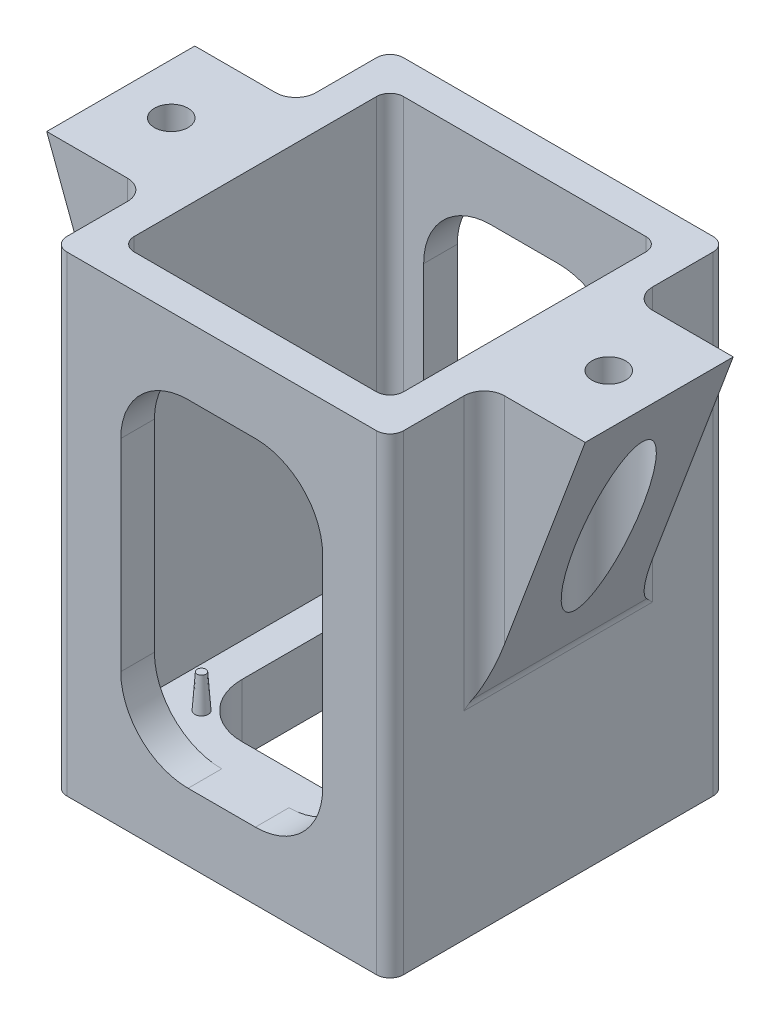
ISO-10303-21;
HEADER;
FILE_DESCRIPTION(('STEP AP214'),'2;1');
FILE_NAME('part.step','',(''),(''),'','','');
FILE_SCHEMA(('AUTOMOTIVE_DESIGN { 1 0 10303 214 1 1 1 1 }'));
ENDSEC;
DATA;
#1=APPLICATION_CONTEXT('core data for automotive mechanical design processes');
#2=APPLICATION_PROTOCOL_DEFINITION('international standard','automotive_design',2000,#1);
#3=PRODUCT_CONTEXT('',#1,'mechanical');
#4=PRODUCT('Part','Part','',(#3));
#5=PRODUCT_RELATED_PRODUCT_CATEGORY('part','',(#4));
#6=PRODUCT_DEFINITION_FORMATION('','',#4);
#7=PRODUCT_DEFINITION_CONTEXT('part definition',#1,'design');
#8=PRODUCT_DEFINITION('design','',#6,#7);
#9=PRODUCT_DEFINITION_SHAPE('','',#8);
#10=(LENGTH_UNIT() NAMED_UNIT(*) SI_UNIT(.MILLI.,.METRE.));
#11=(NAMED_UNIT(*) PLANE_ANGLE_UNIT() SI_UNIT($,.RADIAN.));
#12=(NAMED_UNIT(*) SI_UNIT($,.STERADIAN.) SOLID_ANGLE_UNIT());
#13=UNCERTAINTY_MEASURE_WITH_UNIT(LENGTH_MEASURE(1.E-05),#10,'distance_accuracy_value','');
#14=(GEOMETRIC_REPRESENTATION_CONTEXT(3) GLOBAL_UNCERTAINTY_ASSIGNED_CONTEXT((#13)) GLOBAL_UNIT_ASSIGNED_CONTEXT((#10,
#11,#12)) REPRESENTATION_CONTEXT('',''));
#15=CARTESIAN_POINT('',(0.,0.,0.));
#16=DIRECTION('',(0.,0.,1.));
#17=DIRECTION('',(1.,0.,0.));
#18=AXIS2_PLACEMENT_3D('',#15,#16,#17);
#19=CARTESIAN_POINT('',(-25.,70.,25.));
#20=DIRECTION('',(1.,0.,0.));
#21=DIRECTION('',(0.,0.,-1.));
#22=AXIS2_PLACEMENT_3D('',#19,#20,#21);
#23=PLANE('',#22);
#24=DIRECTION('',(0.,0.,1.));
#25=VECTOR('',#24,1.);
#26=CARTESIAN_POINT('',(-25.,0.,25.));
#27=LINE('',#26,#25);
#28=CARTESIAN_POINT('',(-25.,0.,-23.));
#29=VERTEX_POINT('',#28);
#30=CARTESIAN_POINT('',(-25.,0.,23.));
#31=VERTEX_POINT('',#30);
#32=EDGE_CURVE('E660',#29,#31,#27,.T.);
#33=ORIENTED_EDGE('',*,*,#32,.T.);
#34=DIRECTION('',(0.,-1.,0.));
#35=VECTOR('',#34,1.);
#36=CARTESIAN_POINT('',(-25.,70.,23.));
#37=LINE('',#36,#35);
#38=CARTESIAN_POINT('',(-25.,70.,23.));
#39=VERTEX_POINT('',#38);
#40=EDGE_CURVE('E52',#31,#39,#37,.F.);
#41=ORIENTED_EDGE('',*,*,#40,.T.);
#42=DIRECTION('',(0.,0.,1.));
#43=VECTOR('',#42,1.);
#44=CARTESIAN_POINT('',(-25.,70.,25.));
#45=LINE('',#44,#43);
#46=CARTESIAN_POINT('',(-25.,70.,14.));
#47=VERTEX_POINT('',#46);
#48=EDGE_CURVE('E648',#47,#39,#45,.T.);
#49=ORIENTED_EDGE('',*,*,#48,.F.);
#50=DIRECTION('',(0.,-1.,0.));
#51=VECTOR('',#50,1.);
#52=CARTESIAN_POINT('',(-25.,30.,14.));
#53=LINE('',#52,#51);
#54=CARTESIAN_POINT('',(-25.,30.,14.));
#55=VERTEX_POINT('',#54);
#56=EDGE_CURVE('E687',#47,#55,#53,.T.);
#57=ORIENTED_EDGE('',*,*,#56,.T.);
#58=DIRECTION('',(0.,0.,-1.));
#59=VECTOR('',#58,1.);
#60=CARTESIAN_POINT('',(-25.,30.,11.));
#61=LINE('',#60,#59);
#62=CARTESIAN_POINT('',(-25.,30.,-14.));
#63=VERTEX_POINT('',#62);
#64=EDGE_CURVE('E513',#55,#63,#61,.T.);
#65=ORIENTED_EDGE('',*,*,#64,.T.);
#66=DIRECTION('',(0.,-1.,0.));
#67=VECTOR('',#66,1.);
#68=CARTESIAN_POINT('',(-25.,70.,-14.));
#69=LINE('',#68,#67);
#70=CARTESIAN_POINT('',(-25.,70.,-14.));
#71=VERTEX_POINT('',#70);
#72=EDGE_CURVE('E690',#63,#71,#69,.F.);
#73=ORIENTED_EDGE('',*,*,#72,.T.);
#74=CARTESIAN_POINT('',(-25.,70.,-23.));
#75=VERTEX_POINT('',#74);
#76=EDGE_CURVE('E649',#75,#71,#45,.T.);
#77=ORIENTED_EDGE('',*,*,#76,.F.);
#78=DIRECTION('',(0.,-1.,0.));
#79=VECTOR('',#78,1.);
#80=CARTESIAN_POINT('',(-25.,70.,-23.));
#81=LINE('',#80,#79);
#82=EDGE_CURVE('E783',#75,#29,#81,.T.);
#83=ORIENTED_EDGE('',*,*,#82,.T.);
#84=EDGE_LOOP('',(#33,#41,#49,#57,#65,#73,#77,#83));
#85=FACE_BOUND('',#84,.T.);
#86=ADVANCED_FACE('F37',(#85),#23,.F.);
#87=CARTESIAN_POINT('',(0.,10.,0.));
#88=DIRECTION('',(0.,-1.,0.));
#89=DIRECTION('',(0.,0.,-1.));
#90=AXIS2_PLACEMENT_3D('',#87,#88,#89);
#91=PLANE('',#90);
#92=CARTESIAN_POINT('',(-14.,10.,14.));
#93=DIRECTION('',(0.,-1.,0.));
#94=DIRECTION('',(0.,0.,-1.));
#95=AXIS2_PLACEMENT_3D('',#92,#93,#94);
#96=CIRCLE('',#95,1.00000000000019);
#97=CARTESIAN_POINT('',(-14.,10.,12.9999999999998));
#98=VERTEX_POINT('',#97);
#99=EDGE_CURVE('E673',#98,#98,#96,.F.);
#100=ORIENTED_EDGE('',*,*,#99,.F.);
#101=EDGE_LOOP('',(#100));
#102=FACE_BOUND('',#101,.T.);
#103=CARTESIAN_POINT('',(14.,10.,14.));
#104=DIRECTION('',(0.,-1.,0.));
#105=DIRECTION('',(0.,0.,-1.));
#106=AXIS2_PLACEMENT_3D('',#103,#104,#105);
#107=CIRCLE('',#106,1.00000000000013);
#108=CARTESIAN_POINT('',(14.,10.,12.9999999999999));
#109=VERTEX_POINT('',#108);
#110=EDGE_CURVE('E670',#109,#109,#107,.F.);
#111=ORIENTED_EDGE('',*,*,#110,.F.);
#112=EDGE_LOOP('',(#111));
#113=FACE_BOUND('',#112,.T.);
#114=CARTESIAN_POINT('',(14.,10.,-14.));
#115=DIRECTION('',(0.,-1.,0.));
#116=DIRECTION('',(0.,0.,-1.));
#117=AXIS2_PLACEMENT_3D('',#114,#115,#116);
#118=CIRCLE('',#117,1.00000000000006);
#119=CARTESIAN_POINT('',(14.,10.,-15.0000000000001));
#120=VERTEX_POINT('',#119);
#121=EDGE_CURVE('E667',#120,#120,#118,.F.);
#122=ORIENTED_EDGE('',*,*,#121,.F.);
#123=EDGE_LOOP('',(#122));
#124=FACE_BOUND('',#123,.T.);
#125=CARTESIAN_POINT('',(-14.,10.,-14.));
#126=DIRECTION('',(0.,-1.,0.));
#127=DIRECTION('',(0.,0.,-1.));
#128=AXIS2_PLACEMENT_3D('',#125,#126,#127);
#129=CIRCLE('',#128,1.);
#130=CARTESIAN_POINT('',(-14.,10.,-15.));
#131=VERTEX_POINT('',#130);
#132=EDGE_CURVE('E654',#131,#131,#129,.F.);
#133=ORIENTED_EDGE('',*,*,#132,.F.);
#134=EDGE_LOOP('',(#133));
#135=FACE_BOUND('',#134,.T.);
#136=DIRECTION('',(-1.,0.,0.));
#137=VECTOR('',#136,1.);
#138=CARTESIAN_POINT('',(20.,9.99999999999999,-20.));
#139=LINE('',#138,#137);
#140=CARTESIAN_POINT('',(-4.99999999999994,10.,-20.));
#141=VERTEX_POINT('',#140);
#142=CARTESIAN_POINT('',(-18.,9.99999999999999,-20.));
#143=VERTEX_POINT('',#142);
#144=EDGE_CURVE('E640',#141,#143,#139,.T.);
#145=ORIENTED_EDGE('',*,*,#144,.T.);
#146=CARTESIAN_POINT('',(-18.,9.99999999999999,-18.));
#147=DIRECTION('',(0.,-1.,0.));
#148=DIRECTION('',(0.,0.,-1.));
#149=AXIS2_PLACEMENT_3D('',#146,#147,#148);
#150=CIRCLE('',#149,2.);
#151=CARTESIAN_POINT('',(-20.,9.99999999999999,-18.));
#152=VERTEX_POINT('',#151);
#153=EDGE_CURVE('E746',#143,#152,#150,.F.);
#154=ORIENTED_EDGE('',*,*,#153,.T.);
#155=DIRECTION('',(0.,0.,1.));
#156=VECTOR('',#155,1.);
#157=CARTESIAN_POINT('',(-20.,9.99999999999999,-20.));
#158=LINE('',#157,#156);
#159=CARTESIAN_POINT('',(-20.,9.99999999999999,18.));
#160=VERTEX_POINT('',#159);
#161=EDGE_CURVE('E634',#152,#160,#158,.T.);
#162=ORIENTED_EDGE('',*,*,#161,.T.);
#163=CARTESIAN_POINT('',(-18.,9.99999999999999,18.));
#164=DIRECTION('',(0.,-1.,0.));
#165=DIRECTION('',(0.,0.,-1.));
#166=AXIS2_PLACEMENT_3D('',#163,#164,#165);
#167=CIRCLE('',#166,2.);
#168=CARTESIAN_POINT('',(-18.,9.99999999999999,20.));
#169=VERTEX_POINT('',#168);
#170=EDGE_CURVE('E744',#160,#169,#167,.F.);
#171=ORIENTED_EDGE('',*,*,#170,.T.);
#172=DIRECTION('',(1.,0.,0.));
#173=VECTOR('',#172,1.);
#174=CARTESIAN_POINT('',(-20.,9.99999999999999,20.));
#175=LINE('',#174,#173);
#176=CARTESIAN_POINT('',(-5.00000000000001,9.99999999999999,20.));
#177=VERTEX_POINT('',#176);
#178=EDGE_CURVE('E631',#169,#177,#175,.T.);
#179=ORIENTED_EDGE('',*,*,#178,.T.);
#180=DIRECTION('',(0.,0.,1.));
#181=VECTOR('',#180,1.);
#182=CARTESIAN_POINT('',(-4.99999999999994,10.,-25.001));
#183=LINE('',#182,#181);
#184=CARTESIAN_POINT('',(-4.99999999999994,10.,25.));
#185=VERTEX_POINT('',#184);
#186=EDGE_CURVE('E405',#177,#185,#183,.T.);
#187=ORIENTED_EDGE('',*,*,#186,.T.);
#188=DIRECTION('',(-1.,0.,0.));
#189=VECTOR('',#188,1.);
#190=CARTESIAN_POINT('',(4.99999999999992,10.,25.));
#191=LINE('',#190,#189);
#192=CARTESIAN_POINT('',(4.99999999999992,10.,25.));
#193=VERTEX_POINT('',#192);
#194=EDGE_CURVE('E412',#193,#185,#191,.T.);
#195=ORIENTED_EDGE('',*,*,#194,.F.);
#196=DIRECTION('',(0.,0.,1.));
#197=VECTOR('',#196,1.);
#198=CARTESIAN_POINT('',(4.99999999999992,10.,-25.001));
#199=LINE('',#198,#197);
#200=CARTESIAN_POINT('',(4.99999999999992,9.99999999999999,20.));
#201=VERTEX_POINT('',#200);
#202=EDGE_CURVE('E409',#201,#193,#199,.T.);
#203=ORIENTED_EDGE('',*,*,#202,.F.);
#204=CARTESIAN_POINT('',(18.,9.99999999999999,20.));
#205=VERTEX_POINT('',#204);
#206=EDGE_CURVE('E622',#201,#205,#175,.T.);
#207=ORIENTED_EDGE('',*,*,#206,.T.);
#208=CARTESIAN_POINT('',(18.,9.99999999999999,18.));
#209=DIRECTION('',(0.,-1.,0.));
#210=DIRECTION('',(0.,0.,-1.));
#211=AXIS2_PLACEMENT_3D('',#208,#209,#210);
#212=CIRCLE('',#211,2.);
#213=CARTESIAN_POINT('',(20.,9.99999999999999,18.));
#214=VERTEX_POINT('',#213);
#215=EDGE_CURVE('E740',#205,#214,#212,.F.);
#216=ORIENTED_EDGE('',*,*,#215,.T.);
#217=DIRECTION('',(0.,0.,-1.));
#218=VECTOR('',#217,1.);
#219=CARTESIAN_POINT('',(20.,9.99999999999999,20.));
#220=LINE('',#219,#218);
#221=CARTESIAN_POINT('',(20.,9.99999999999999,-18.));
#222=VERTEX_POINT('',#221);
#223=EDGE_CURVE('E633',#214,#222,#220,.T.);
#224=ORIENTED_EDGE('',*,*,#223,.T.);
#225=CARTESIAN_POINT('',(18.,9.99999999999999,-18.));
#226=DIRECTION('',(0.,-1.,0.));
#227=DIRECTION('',(0.,0.,-1.));
#228=AXIS2_PLACEMENT_3D('',#225,#226,#227);
#229=CIRCLE('',#228,2.);
#230=CARTESIAN_POINT('',(18.,9.99999999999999,-20.));
#231=VERTEX_POINT('',#230);
#232=EDGE_CURVE('E742',#222,#231,#229,.F.);
#233=ORIENTED_EDGE('',*,*,#232,.T.);
#234=CARTESIAN_POINT('',(4.99999999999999,9.99999999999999,-20.));
#235=VERTEX_POINT('',#234);
#236=EDGE_CURVE('E638',#231,#235,#139,.T.);
#237=ORIENTED_EDGE('',*,*,#236,.T.);
#238=DIRECTION('',(0.,0.,-1.));
#239=VECTOR('',#238,1.);
#240=CARTESIAN_POINT('',(4.99999999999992,10.,25.001));
#241=LINE('',#240,#239);
#242=CARTESIAN_POINT('',(4.99999999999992,10.,-25.));
#243=VERTEX_POINT('',#242);
#244=EDGE_CURVE('E480',#235,#243,#241,.T.);
#245=ORIENTED_EDGE('',*,*,#244,.T.);
#246=DIRECTION('',(-1.,0.,0.));
#247=VECTOR('',#246,1.);
#248=CARTESIAN_POINT('',(4.99999999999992,10.,-25.));
#249=LINE('',#248,#247);
#250=CARTESIAN_POINT('',(-4.99999999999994,10.,-25.));
#251=VERTEX_POINT('',#250);
#252=EDGE_CURVE('E454',#243,#251,#249,.T.);
#253=ORIENTED_EDGE('',*,*,#252,.T.);
#254=DIRECTION('',(0.,0.,-1.));
#255=VECTOR('',#254,1.);
#256=CARTESIAN_POINT('',(-4.99999999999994,10.,25.001));
#257=LINE('',#256,#255);
#258=EDGE_CURVE('E438',#141,#251,#257,.T.);
#259=ORIENTED_EDGE('',*,*,#258,.F.);
#260=EDGE_LOOP('',(#145,#154,#162,#171,#179,#187,#195,#203,#207,#216,#224,#233,#237,#245,#253,#259));
#261=FACE_BOUND('',#260,.T.);
#262=CARTESIAN_POINT('',(-7.00000000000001,10.,7.));
#263=DIRECTION('',(0.,1.,0.));
#264=DIRECTION('',(0.,0.,1.));
#265=AXIS2_PLACEMENT_3D('',#262,#263,#264);
#266=CIRCLE('',#265,8.);
#267=CARTESIAN_POINT('',(-15.,10.,6.99999999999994));
#268=VERTEX_POINT('',#267);
#269=CARTESIAN_POINT('',(-6.99999999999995,10.,15.));
#270=VERTEX_POINT('',#269);
#271=EDGE_CURVE('E554',#268,#270,#266,.T.);
#272=ORIENTED_EDGE('',*,*,#271,.F.);
#273=DIRECTION('',(0.,0.,1.));
#274=VECTOR('',#273,1.);
#275=CARTESIAN_POINT('',(-15.,10.,-6.99999999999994));
#276=LINE('',#275,#274);
#277=CARTESIAN_POINT('',(-15.,10.,-6.99999999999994));
#278=VERTEX_POINT('',#277);
#279=EDGE_CURVE('E555',#278,#268,#276,.T.);
#280=ORIENTED_EDGE('',*,*,#279,.F.);
#281=CARTESIAN_POINT('',(-7.00000000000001,10.,-7.));
#282=DIRECTION('',(0.,1.,0.));
#283=DIRECTION('',(0.,0.,1.));
#284=AXIS2_PLACEMENT_3D('',#281,#282,#283);
#285=CIRCLE('',#284,8.);
#286=CARTESIAN_POINT('',(-6.99999999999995,10.,-15.));
#287=VERTEX_POINT('',#286);
#288=EDGE_CURVE('E559',#287,#278,#285,.T.);
#289=ORIENTED_EDGE('',*,*,#288,.F.);
#290=DIRECTION('',(-1.,0.,0.));
#291=VECTOR('',#290,1.);
#292=CARTESIAN_POINT('',(6.99999999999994,10.,-15.));
#293=LINE('',#292,#291);
#294=CARTESIAN_POINT('',(6.99999999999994,10.,-15.));
#295=VERTEX_POINT('',#294);
#296=EDGE_CURVE('E561',#295,#287,#293,.T.);
#297=ORIENTED_EDGE('',*,*,#296,.F.);
#298=CARTESIAN_POINT('',(6.99999999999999,10.,-7.));
#299=DIRECTION('',(0.,1.,0.));
#300=DIRECTION('',(0.,0.,-1.));
#301=AXIS2_PLACEMENT_3D('',#298,#299,#300);
#302=CIRCLE('',#301,8.);
#303=CARTESIAN_POINT('',(15.,10.,-6.99999999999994));
#304=VERTEX_POINT('',#303);
#305=EDGE_CURVE('E564',#304,#295,#302,.T.);
#306=ORIENTED_EDGE('',*,*,#305,.F.);
#307=DIRECTION('',(0.,0.,-1.));
#308=VECTOR('',#307,1.);
#309=CARTESIAN_POINT('',(15.,10.,6.99999999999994));
#310=LINE('',#309,#308);
#311=CARTESIAN_POINT('',(15.,10.,6.99999999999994));
#312=VERTEX_POINT('',#311);
#313=EDGE_CURVE('E567',#312,#304,#310,.T.);
#314=ORIENTED_EDGE('',*,*,#313,.F.);
#315=CARTESIAN_POINT('',(6.99999999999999,10.,7.));
#316=DIRECTION('',(0.,1.,0.));
#317=DIRECTION('',(0.,0.,1.));
#318=AXIS2_PLACEMENT_3D('',#315,#316,#317);
#319=CIRCLE('',#318,8.);
#320=CARTESIAN_POINT('',(6.99999999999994,10.,15.));
#321=VERTEX_POINT('',#320);
#322=EDGE_CURVE('E570',#321,#312,#319,.T.);
#323=ORIENTED_EDGE('',*,*,#322,.F.);
#324=DIRECTION('',(1.,0.,0.));
#325=VECTOR('',#324,1.);
#326=CARTESIAN_POINT('',(-6.99999999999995,10.,15.));
#327=LINE('',#326,#325);
#328=EDGE_CURVE('E573',#270,#321,#327,.T.);
#329=ORIENTED_EDGE('',*,*,#328,.F.);
#330=EDGE_LOOP('',(#272,#280,#289,#297,#306,#314,#323,#329));
#331=FACE_BOUND('',#330,.T.);
#332=ADVANCED_FACE('F811',(#102,#113,#124,#135,#261,#331),#91,.F.);
#333=CARTESIAN_POINT('',(25.,70.,25.));
#334=DIRECTION('',(-1.,0.,0.));
#335=DIRECTION('',(0.,0.,1.));
#336=AXIS2_PLACEMENT_3D('',#333,#334,#335);
#337=PLANE('',#336);
#338=DIRECTION('',(0.,0.,-1.));
#339=VECTOR('',#338,1.);
#340=CARTESIAN_POINT('',(25.,70.,25.));
#341=LINE('',#340,#339);
#342=CARTESIAN_POINT('',(25.,70.,23.));
#343=VERTEX_POINT('',#342);
#344=CARTESIAN_POINT('',(25.,70.,14.));
#345=VERTEX_POINT('',#344);
#346=EDGE_CURVE('E643',#343,#345,#341,.T.);
#347=ORIENTED_EDGE('',*,*,#346,.F.);
#348=DIRECTION('',(0.,-1.,0.));
#349=VECTOR('',#348,1.);
#350=CARTESIAN_POINT('',(25.,70.,23.));
#351=LINE('',#350,#349);
#352=CARTESIAN_POINT('',(25.,0.,23.));
#353=VERTEX_POINT('',#352);
#354=EDGE_CURVE('E760',#343,#353,#351,.T.);
#355=ORIENTED_EDGE('',*,*,#354,.T.);
#356=DIRECTION('',(0.,0.,-1.));
#357=VECTOR('',#356,1.);
#358=CARTESIAN_POINT('',(25.,0.,25.));
#359=LINE('',#358,#357);
#360=CARTESIAN_POINT('',(25.,0.,-23.));
#361=VERTEX_POINT('',#360);
#362=EDGE_CURVE('E637',#353,#361,#359,.T.);
#363=ORIENTED_EDGE('',*,*,#362,.T.);
#364=DIRECTION('',(0.,-1.,0.));
#365=VECTOR('',#364,1.);
#366=CARTESIAN_POINT('',(25.,70.,-23.));
#367=LINE('',#366,#365);
#368=CARTESIAN_POINT('',(25.,70.,-23.));
#369=VERTEX_POINT('',#368);
#370=EDGE_CURVE('E758',#361,#369,#367,.F.);
#371=ORIENTED_EDGE('',*,*,#370,.T.);
#372=CARTESIAN_POINT('',(25.,70.,-14.));
#373=VERTEX_POINT('',#372);
#374=EDGE_CURVE('E646',#373,#369,#341,.T.);
#375=ORIENTED_EDGE('',*,*,#374,.F.);
#376=DIRECTION('',(0.,-1.,0.));
#377=VECTOR('',#376,1.);
#378=CARTESIAN_POINT('',(25.,70.,-14.));
#379=LINE('',#378,#377);
#380=CARTESIAN_POINT('',(25.,29.4559962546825,-14.));
#381=VERTEX_POINT('',#380);
#382=EDGE_CURVE('E700',#373,#381,#379,.T.);
#383=ORIENTED_EDGE('',*,*,#382,.T.);
#384=DIRECTION('',(0.,0.,-1.));
#385=VECTOR('',#384,1.);
#386=CARTESIAN_POINT('',(25.,29.4559962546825,11.));
#387=LINE('',#386,#385);
#388=CARTESIAN_POINT('',(25.,29.4559962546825,14.));
#389=VERTEX_POINT('',#388);
#390=EDGE_CURVE('E698',#381,#389,#387,.F.);
#391=ORIENTED_EDGE('',*,*,#390,.T.);
#392=DIRECTION('',(0.,-1.,0.));
#393=VECTOR('',#392,1.);
#394=CARTESIAN_POINT('',(25.,70.,14.));
#395=LINE('',#394,#393);
#396=EDGE_CURVE('E695',#389,#345,#395,.F.);
#397=ORIENTED_EDGE('',*,*,#396,.T.);
#398=EDGE_LOOP('',(#347,#355,#363,#371,#375,#383,#391,#397));
#399=FACE_BOUND('',#398,.T.);
#400=ADVANCED_FACE('F888',(#399),#337,.F.);
#401=CARTESIAN_POINT('',(-25.,70.,-25.));
#402=DIRECTION('',(0.,0.,1.));
#403=DIRECTION('',(1.,0.,0.));
#404=AXIS2_PLACEMENT_3D('',#401,#402,#403);
#405=PLANE('',#404);
#406=CARTESIAN_POINT('',(-5.00000000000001,20.,-25.));
#407=DIRECTION('',(0.,0.,-1.));
#408=DIRECTION('',(-1.,0.,0.));
#409=AXIS2_PLACEMENT_3D('',#406,#407,#408);
#410=CIRCLE('',#409,10.);
#411=CARTESIAN_POINT('',(-15.,20.,-25.));
#412=VERTEX_POINT('',#411);
#413=EDGE_CURVE('E451',#251,#412,#410,.T.);
#414=ORIENTED_EDGE('',*,*,#413,.F.);
#415=ORIENTED_EDGE('',*,*,#252,.F.);
#416=CARTESIAN_POINT('',(4.99999999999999,20.,-25.));
#417=DIRECTION('',(0.,0.,-1.));
#418=DIRECTION('',(1.,0.,0.));
#419=AXIS2_PLACEMENT_3D('',#416,#417,#418);
#420=CIRCLE('',#419,10.);
#421=CARTESIAN_POINT('',(15.,20.,-25.));
#422=VERTEX_POINT('',#421);
#423=EDGE_CURVE('E457',#422,#243,#420,.T.);
#424=ORIENTED_EDGE('',*,*,#423,.F.);
#425=DIRECTION('',(0.,-1.,0.));
#426=VECTOR('',#425,1.);
#427=CARTESIAN_POINT('',(15.,50.,-25.));
#428=LINE('',#427,#426);
#429=CARTESIAN_POINT('',(15.,50.,-25.));
#430=VERTEX_POINT('',#429);
#431=EDGE_CURVE('E436',#430,#422,#428,.T.);
#432=ORIENTED_EDGE('',*,*,#431,.F.);
#433=CARTESIAN_POINT('',(4.99999999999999,50.,-25.));
#434=DIRECTION('',(0.,0.,-1.));
#435=DIRECTION('',(-1.,0.,0.));
#436=AXIS2_PLACEMENT_3D('',#433,#434,#435);
#437=CIRCLE('',#436,10.);
#438=CARTESIAN_POINT('',(4.99999999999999,60.,-25.));
#439=VERTEX_POINT('',#438);
#440=EDGE_CURVE('E439',#439,#430,#437,.T.);
#441=ORIENTED_EDGE('',*,*,#440,.F.);
#442=DIRECTION('',(1.,0.,0.));
#443=VECTOR('',#442,1.);
#444=CARTESIAN_POINT('',(-5.00000000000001,60.,-25.));
#445=LINE('',#444,#443);
#446=CARTESIAN_POINT('',(-5.00000000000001,60.,-25.));
#447=VERTEX_POINT('',#446);
#448=EDGE_CURVE('E442',#447,#439,#445,.T.);
#449=ORIENTED_EDGE('',*,*,#448,.F.);
#450=CARTESIAN_POINT('',(-5.00000000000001,50.,-25.));
#451=DIRECTION('',(0.,0.,-1.));
#452=DIRECTION('',(-1.,0.,0.));
#453=AXIS2_PLACEMENT_3D('',#450,#451,#452);
#454=CIRCLE('',#453,10.);
#455=CARTESIAN_POINT('',(-15.,50.,-25.));
#456=VERTEX_POINT('',#455);
#457=EDGE_CURVE('E445',#456,#447,#454,.T.);
#458=ORIENTED_EDGE('',*,*,#457,.F.);
#459=DIRECTION('',(0.,1.,0.));
#460=VECTOR('',#459,1.);
#461=CARTESIAN_POINT('',(-15.,20.0000000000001,-25.));
#462=LINE('',#461,#460);
#463=EDGE_CURVE('E448',#412,#456,#462,.T.);
#464=ORIENTED_EDGE('',*,*,#463,.F.);
#465=EDGE_LOOP('',(#414,#415,#424,#432,#441,#449,#458,#464));
#466=FACE_BOUND('',#465,.T.);
#467=DIRECTION('',(-1.,0.,0.));
#468=VECTOR('',#467,1.);
#469=CARTESIAN_POINT('',(-25.,0.,-25.));
#470=LINE('',#469,#468);
#471=CARTESIAN_POINT('',(23.,0.,-25.));
#472=VERTEX_POINT('',#471);
#473=CARTESIAN_POINT('',(-23.,0.,-25.));
#474=VERTEX_POINT('',#473);
#475=EDGE_CURVE('E657',#472,#474,#470,.T.);
#476=ORIENTED_EDGE('',*,*,#475,.T.);
#477=DIRECTION('',(0.,-1.,0.));
#478=VECTOR('',#477,1.);
#479=CARTESIAN_POINT('',(-23.,70.,-25.));
#480=LINE('',#479,#478);
#481=CARTESIAN_POINT('',(-23.,70.,-25.));
#482=VERTEX_POINT('',#481);
#483=EDGE_CURVE('E790',#474,#482,#480,.F.);
#484=ORIENTED_EDGE('',*,*,#483,.T.);
#485=DIRECTION('',(-1.,0.,0.));
#486=VECTOR('',#485,1.);
#487=CARTESIAN_POINT('',(-25.,70.,-25.));
#488=LINE('',#487,#486);
#489=CARTESIAN_POINT('',(23.,70.,-25.));
#490=VERTEX_POINT('',#489);
#491=EDGE_CURVE('E645',#490,#482,#488,.T.);
#492=ORIENTED_EDGE('',*,*,#491,.F.);
#493=DIRECTION('',(0.,-1.,0.));
#494=VECTOR('',#493,1.);
#495=CARTESIAN_POINT('',(23.,70.,-25.));
#496=LINE('',#495,#494);
#497=EDGE_CURVE('E787',#490,#472,#496,.T.);
#498=ORIENTED_EDGE('',*,*,#497,.T.);
#499=EDGE_LOOP('',(#476,#484,#492,#498));
#500=FACE_BOUND('',#499,.T.);
#501=ADVANCED_FACE('F826',(#466,#500),#405,.F.);
#502=CARTESIAN_POINT('',(-25.,70.,25.));
#503=DIRECTION('',(0.,0.,-1.));
#504=DIRECTION('',(-1.,0.,0.));
#505=AXIS2_PLACEMENT_3D('',#502,#503,#504);
#506=PLANE('',#505);
#507=DIRECTION('',(0.,-1.,0.));
#508=VECTOR('',#507,1.);
#509=CARTESIAN_POINT('',(15.,50.,25.));
#510=LINE('',#509,#508);
#511=CARTESIAN_POINT('',(15.,50.,25.));
#512=VERTEX_POINT('',#511);
#513=CARTESIAN_POINT('',(15.,20.0000000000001,25.));
#514=VERTEX_POINT('',#513);
#515=EDGE_CURVE('E372',#512,#514,#510,.T.);
#516=ORIENTED_EDGE('',*,*,#515,.T.);
#517=CARTESIAN_POINT('',(4.99999999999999,20.,25.));
#518=DIRECTION('',(0.,0.,-1.));
#519=DIRECTION('',(1.,0.,0.));
#520=AXIS2_PLACEMENT_3D('',#517,#518,#519);
#521=CIRCLE('',#520,10.);
#522=EDGE_CURVE('E389',#514,#193,#521,.T.);
#523=ORIENTED_EDGE('',*,*,#522,.T.);
#524=ORIENTED_EDGE('',*,*,#194,.T.);
#525=CARTESIAN_POINT('',(-5.00000000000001,20.,25.));
#526=DIRECTION('',(0.,0.,-1.));
#527=DIRECTION('',(-1.,0.,0.));
#528=AXIS2_PLACEMENT_3D('',#525,#526,#527);
#529=CIRCLE('',#528,10.);
#530=CARTESIAN_POINT('',(-15.,20.,25.));
#531=VERTEX_POINT('',#530);
#532=EDGE_CURVE('E407',#185,#531,#529,.T.);
#533=ORIENTED_EDGE('',*,*,#532,.T.);
#534=DIRECTION('',(0.,1.,0.));
#535=VECTOR('',#534,1.);
#536=CARTESIAN_POINT('',(-15.,20.0000000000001,25.));
#537=LINE('',#536,#535);
#538=CARTESIAN_POINT('',(-15.,50.,25.));
#539=VERTEX_POINT('',#538);
#540=EDGE_CURVE('E403',#531,#539,#537,.T.);
#541=ORIENTED_EDGE('',*,*,#540,.T.);
#542=CARTESIAN_POINT('',(-5.00000000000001,50.,25.));
#543=DIRECTION('',(0.,0.,-1.));
#544=DIRECTION('',(-1.,0.,0.));
#545=AXIS2_PLACEMENT_3D('',#542,#543,#544);
#546=CIRCLE('',#545,10.);
#547=CARTESIAN_POINT('',(-5.00000000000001,60.,25.));
#548=VERTEX_POINT('',#547);
#549=EDGE_CURVE('E399',#539,#548,#546,.T.);
#550=ORIENTED_EDGE('',*,*,#549,.T.);
#551=DIRECTION('',(1.,0.,0.));
#552=VECTOR('',#551,1.);
#553=CARTESIAN_POINT('',(-5.00000000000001,60.,25.));
#554=LINE('',#553,#552);
#555=CARTESIAN_POINT('',(4.99999999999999,60.,25.));
#556=VERTEX_POINT('',#555);
#557=EDGE_CURVE('E395',#548,#556,#554,.T.);
#558=ORIENTED_EDGE('',*,*,#557,.T.);
#559=CARTESIAN_POINT('',(4.99999999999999,50.,25.));
#560=DIRECTION('',(0.,0.,-1.));
#561=DIRECTION('',(-1.,0.,0.));
#562=AXIS2_PLACEMENT_3D('',#559,#560,#561);
#563=CIRCLE('',#562,10.);
#564=EDGE_CURVE('E392',#556,#512,#563,.T.);
#565=ORIENTED_EDGE('',*,*,#564,.T.);
#566=EDGE_LOOP('',(#516,#523,#524,#533,#541,#550,#558,#565));
#567=FACE_BOUND('',#566,.T.);
#568=DIRECTION('',(1.,0.,0.));
#569=VECTOR('',#568,1.);
#570=CARTESIAN_POINT('',(-25.,0.,25.));
#571=LINE('',#570,#569);
#572=CARTESIAN_POINT('',(-23.,0.,25.));
#573=VERTEX_POINT('',#572);
#574=CARTESIAN_POINT('',(23.,0.,25.));
#575=VERTEX_POINT('',#574);
#576=EDGE_CURVE('E662',#573,#575,#571,.T.);
#577=ORIENTED_EDGE('',*,*,#576,.T.);
#578=DIRECTION('',(0.,-1.,0.));
#579=VECTOR('',#578,1.);
#580=CARTESIAN_POINT('',(23.,70.,25.));
#581=LINE('',#580,#579);
#582=CARTESIAN_POINT('',(23.,70.,25.));
#583=VERTEX_POINT('',#582);
#584=EDGE_CURVE('E774',#575,#583,#581,.F.);
#585=ORIENTED_EDGE('',*,*,#584,.T.);
#586=DIRECTION('',(1.,0.,0.));
#587=VECTOR('',#586,1.);
#588=CARTESIAN_POINT('',(-25.,70.,25.));
#589=LINE('',#588,#587);
#590=CARTESIAN_POINT('',(-23.,70.,25.));
#591=VERTEX_POINT('',#590);
#592=EDGE_CURVE('E651',#591,#583,#589,.T.);
#593=ORIENTED_EDGE('',*,*,#592,.F.);
#594=DIRECTION('',(0.,-1.,0.));
#595=VECTOR('',#594,1.);
#596=CARTESIAN_POINT('',(-23.,70.,25.));
#597=LINE('',#596,#595);
#598=EDGE_CURVE('E771',#591,#573,#597,.T.);
#599=ORIENTED_EDGE('',*,*,#598,.T.);
#600=EDGE_LOOP('',(#577,#585,#593,#599));
#601=FACE_BOUND('',#600,.T.);
#602=ADVANCED_FACE('F857',(#567,#601),#506,.F.);
#603=CARTESIAN_POINT('',(0.,70.,0.));
#604=DIRECTION('',(0.,-1.,0.));
#605=DIRECTION('',(0.,0.,-1.));
#606=AXIS2_PLACEMENT_3D('',#603,#604,#605);
#607=PLANE('',#606);
#608=CARTESIAN_POINT('',(-32.5,70.,0.));
#609=DIRECTION('',(0.,-1.,0.));
#610=DIRECTION('',(0.,0.,1.));
#611=AXIS2_PLACEMENT_3D('',#608,#609,#610);
#612=CIRCLE('',#611,2.5);
#613=CARTESIAN_POINT('',(-32.5,70.,2.5));
#614=VERTEX_POINT('',#613);
#615=EDGE_CURVE('E502',#614,#614,#612,.T.);
#616=ORIENTED_EDGE('',*,*,#615,.T.);
#617=EDGE_LOOP('',(#616));
#618=FACE_BOUND('',#617,.T.);
#619=CARTESIAN_POINT('',(32.5,70.,0.));
#620=DIRECTION('',(0.,1.,0.));
#621=DIRECTION('',(0.,0.,1.));
#622=AXIS2_PLACEMENT_3D('',#619,#620,#621);
#623=CIRCLE('',#622,2.5);
#624=CARTESIAN_POINT('',(32.5,70.,2.5));
#625=VERTEX_POINT('',#624);
#626=EDGE_CURVE('E525',#625,#625,#623,.T.);
#627=ORIENTED_EDGE('',*,*,#626,.F.);
#628=EDGE_LOOP('',(#627));
#629=FACE_BOUND('',#628,.T.);
#630=DIRECTION('',(0.,0.,-1.));
#631=VECTOR('',#630,1.);
#632=CARTESIAN_POINT('',(20.,70.,20.));
#633=LINE('',#632,#631);
#634=CARTESIAN_POINT('',(20.,70.,18.));
#635=VERTEX_POINT('',#634);
#636=CARTESIAN_POINT('',(20.,70.,-18.));
#637=VERTEX_POINT('',#636);
#638=EDGE_CURVE('E623',#635,#637,#633,.T.);
#639=ORIENTED_EDGE('',*,*,#638,.F.);
#640=CARTESIAN_POINT('',(18.,70.,18.));
#641=DIRECTION('',(0.,-1.,0.));
#642=DIRECTION('',(0.,0.,-1.));
#643=AXIS2_PLACEMENT_3D('',#640,#641,#642);
#644=CIRCLE('',#643,2.);
#645=CARTESIAN_POINT('',(18.,70.,20.));
#646=VERTEX_POINT('',#645);
#647=EDGE_CURVE('E12',#635,#646,#644,.T.);
#648=ORIENTED_EDGE('',*,*,#647,.T.);
#649=DIRECTION('',(1.,0.,0.));
#650=VECTOR('',#649,1.);
#651=CARTESIAN_POINT('',(-20.,70.,20.));
#652=LINE('',#651,#650);
#653=CARTESIAN_POINT('',(-18.,70.,20.));
#654=VERTEX_POINT('',#653);
#655=EDGE_CURVE('E626',#654,#646,#652,.T.);
#656=ORIENTED_EDGE('',*,*,#655,.F.);
#657=CARTESIAN_POINT('',(-18.,70.,18.));
#658=DIRECTION('',(0.,-1.,0.));
#659=DIRECTION('',(0.,0.,-1.));
#660=AXIS2_PLACEMENT_3D('',#657,#658,#659);
#661=CIRCLE('',#660,2.);
#662=CARTESIAN_POINT('',(-20.,70.,18.));
#663=VERTEX_POINT('',#662);
#664=EDGE_CURVE('E794',#654,#663,#661,.T.);
#665=ORIENTED_EDGE('',*,*,#664,.T.);
#666=DIRECTION('',(0.,0.,1.));
#667=VECTOR('',#666,1.);
#668=CARTESIAN_POINT('',(-20.,70.,-20.));
#669=LINE('',#668,#667);
#670=CARTESIAN_POINT('',(-20.,70.,-18.));
#671=VERTEX_POINT('',#670);
#672=EDGE_CURVE('E618',#671,#663,#669,.T.);
#673=ORIENTED_EDGE('',*,*,#672,.F.);
#674=CARTESIAN_POINT('',(-18.,70.,-18.));
#675=DIRECTION('',(0.,-1.,0.));
#676=DIRECTION('',(0.,0.,-1.));
#677=AXIS2_PLACEMENT_3D('',#674,#675,#676);
#678=CIRCLE('',#677,2.);
#679=CARTESIAN_POINT('',(-18.,70.,-20.));
#680=VERTEX_POINT('',#679);
#681=EDGE_CURVE('E792',#671,#680,#678,.T.);
#682=ORIENTED_EDGE('',*,*,#681,.T.);
#683=DIRECTION('',(-1.,0.,0.));
#684=VECTOR('',#683,1.);
#685=CARTESIAN_POINT('',(20.,70.,-20.));
#686=LINE('',#685,#684);
#687=CARTESIAN_POINT('',(18.,70.,-20.));
#688=VERTEX_POINT('',#687);
#689=EDGE_CURVE('E619',#688,#680,#686,.T.);
#690=ORIENTED_EDGE('',*,*,#689,.F.);
#691=CARTESIAN_POINT('',(18.,70.,-18.));
#692=DIRECTION('',(0.,-1.,0.));
#693=DIRECTION('',(0.,0.,-1.));
#694=AXIS2_PLACEMENT_3D('',#691,#692,#693);
#695=CIRCLE('',#694,2.);
#696=EDGE_CURVE('E45',#688,#637,#695,.T.);
#697=ORIENTED_EDGE('',*,*,#696,.T.);
#698=EDGE_LOOP('',(#639,#648,#656,#665,#673,#682,#690,#697));
#699=FACE_BOUND('',#698,.T.);
#700=ORIENTED_EDGE('',*,*,#592,.T.);
#701=CARTESIAN_POINT('',(23.,70.,23.));
#702=DIRECTION('',(0.,-1.,0.));
#703=DIRECTION('',(0.,0.,-1.));
#704=AXIS2_PLACEMENT_3D('',#701,#702,#703);
#705=CIRCLE('',#704,2.);
#706=EDGE_CURVE('E781',#583,#343,#705,.F.);
#707=ORIENTED_EDGE('',*,*,#706,.T.);
#708=ORIENTED_EDGE('',*,*,#346,.T.);
#709=CARTESIAN_POINT('',(28.,70.,14.));
#710=DIRECTION('',(0.,-1.,0.));
#711=DIRECTION('',(0.,0.,-1.));
#712=AXIS2_PLACEMENT_3D('',#709,#710,#711);
#713=CIRCLE('',#712,3.);
#714=CARTESIAN_POINT('',(28.,70.,11.));
#715=VERTEX_POINT('',#714);
#716=EDGE_CURVE('E725',#345,#715,#713,.T.);
#717=ORIENTED_EDGE('',*,*,#716,.T.);
#718=DIRECTION('',(-1.,0.,0.));
#719=VECTOR('',#718,1.);
#720=CARTESIAN_POINT('',(25.,70.,11.));
#721=LINE('',#720,#719);
#722=CARTESIAN_POINT('',(40.,70.,11.));
#723=VERTEX_POINT('',#722);
#724=EDGE_CURVE('E530',#723,#715,#721,.T.);
#725=ORIENTED_EDGE('',*,*,#724,.F.);
#726=DIRECTION('',(0.,0.,-1.));
#727=VECTOR('',#726,1.);
#728=CARTESIAN_POINT('',(40.,70.,11.));
#729=LINE('',#728,#727);
#730=CARTESIAN_POINT('',(40.,70.,-11.));
#731=VERTEX_POINT('',#730);
#732=EDGE_CURVE('E536',#723,#731,#729,.T.);
#733=ORIENTED_EDGE('',*,*,#732,.T.);
#734=DIRECTION('',(-1.,0.,0.));
#735=VECTOR('',#734,1.);
#736=CARTESIAN_POINT('',(25.,70.,-11.));
#737=LINE('',#736,#735);
#738=CARTESIAN_POINT('',(28.,70.,-11.));
#739=VERTEX_POINT('',#738);
#740=EDGE_CURVE('E528',#731,#739,#737,.T.);
#741=ORIENTED_EDGE('',*,*,#740,.T.);
#742=CARTESIAN_POINT('',(28.,70.,-14.));
#743=DIRECTION('',(0.,-1.,0.));
#744=DIRECTION('',(0.,0.,-1.));
#745=AXIS2_PLACEMENT_3D('',#742,#743,#744);
#746=CIRCLE('',#745,3.);
#747=EDGE_CURVE('E720',#739,#373,#746,.T.);
#748=ORIENTED_EDGE('',*,*,#747,.T.);
#749=ORIENTED_EDGE('',*,*,#374,.T.);
#750=CARTESIAN_POINT('',(23.,70.,-23.));
#751=DIRECTION('',(0.,-1.,0.));
#752=DIRECTION('',(0.,0.,-1.));
#753=AXIS2_PLACEMENT_3D('',#750,#751,#752);
#754=CIRCLE('',#753,2.);
#755=EDGE_CURVE('E776',#369,#490,#754,.F.);
#756=ORIENTED_EDGE('',*,*,#755,.T.);
#757=ORIENTED_EDGE('',*,*,#491,.T.);
#758=CARTESIAN_POINT('',(-23.,70.,-23.));
#759=DIRECTION('',(0.,-1.,0.));
#760=DIRECTION('',(0.,0.,-1.));
#761=AXIS2_PLACEMENT_3D('',#758,#759,#760);
#762=CIRCLE('',#761,2.);
#763=EDGE_CURVE('E60',#482,#75,#762,.F.);
#764=ORIENTED_EDGE('',*,*,#763,.T.);
#765=ORIENTED_EDGE('',*,*,#76,.T.);
#766=CARTESIAN_POINT('',(-28.,70.,-14.));
#767=DIRECTION('',(0.,-1.,0.));
#768=DIRECTION('',(0.,0.,-1.));
#769=AXIS2_PLACEMENT_3D('',#766,#767,#768);
#770=CIRCLE('',#769,3.);
#771=CARTESIAN_POINT('',(-28.,70.,-11.));
#772=VERTEX_POINT('',#771);
#773=EDGE_CURVE('E712',#71,#772,#770,.T.);
#774=ORIENTED_EDGE('',*,*,#773,.T.);
#775=DIRECTION('',(1.,0.,0.));
#776=VECTOR('',#775,1.);
#777=CARTESIAN_POINT('',(-25.,70.,-11.));
#778=LINE('',#777,#776);
#779=CARTESIAN_POINT('',(-40.,70.,-11.));
#780=VERTEX_POINT('',#779);
#781=EDGE_CURVE('E505',#780,#772,#778,.T.);
#782=ORIENTED_EDGE('',*,*,#781,.F.);
#783=DIRECTION('',(0.,0.,-1.));
#784=VECTOR('',#783,1.);
#785=CARTESIAN_POINT('',(-40.,70.,11.));
#786=LINE('',#785,#784);
#787=CARTESIAN_POINT('',(-40.,70.,11.));
#788=VERTEX_POINT('',#787);
#789=EDGE_CURVE('E518',#788,#780,#786,.T.);
#790=ORIENTED_EDGE('',*,*,#789,.F.);
#791=DIRECTION('',(1.,0.,0.));
#792=VECTOR('',#791,1.);
#793=CARTESIAN_POINT('',(-25.,70.,11.));
#794=LINE('',#793,#792);
#795=CARTESIAN_POINT('',(-28.,70.,11.));
#796=VERTEX_POINT('',#795);
#797=EDGE_CURVE('E507',#788,#796,#794,.T.);
#798=ORIENTED_EDGE('',*,*,#797,.T.);
#799=CARTESIAN_POINT('',(-28.,70.,14.));
#800=DIRECTION('',(0.,-1.,0.));
#801=DIRECTION('',(0.,0.,-1.));
#802=AXIS2_PLACEMENT_3D('',#799,#800,#801);
#803=CIRCLE('',#802,3.);
#804=EDGE_CURVE('E716',#796,#47,#803,.T.);
#805=ORIENTED_EDGE('',*,*,#804,.T.);
#806=ORIENTED_EDGE('',*,*,#48,.T.);
#807=CARTESIAN_POINT('',(-23.,70.,23.));
#808=DIRECTION('',(0.,-1.,0.));
#809=DIRECTION('',(0.,0.,-1.));
#810=AXIS2_PLACEMENT_3D('',#807,#808,#809);
#811=CIRCLE('',#810,2.);
#812=EDGE_CURVE('E779',#39,#591,#811,.F.);
#813=ORIENTED_EDGE('',*,*,#812,.T.);
#814=EDGE_LOOP('',(#700,#707,#708,#717,#725,#733,#741,#748,#749,#756,#757,#764,#765,#774,#782,
#790,#798,#805,#806,#813));
#815=FACE_BOUND('',#814,.T.);
#816=ADVANCED_FACE('F798',(#618,#629,#699,#815),#607,.F.);
#817=CARTESIAN_POINT('',(0.,0.,0.));
#818=DIRECTION('',(0.,-1.,0.));
#819=DIRECTION('',(0.,0.,-1.));
#820=AXIS2_PLACEMENT_3D('',#817,#818,#819);
#821=PLANE('',#820);
#822=DIRECTION('',(1.,0.,0.));
#823=VECTOR('',#822,1.);
#824=CARTESIAN_POINT('',(-6.99999999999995,0.,15.));
#825=LINE('',#824,#823);
#826=CARTESIAN_POINT('',(-6.99999999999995,0.,15.));
#827=VERTEX_POINT('',#826);
#828=CARTESIAN_POINT('',(6.99999999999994,0.,15.));
#829=VERTEX_POINT('',#828);
#830=EDGE_CURVE('E558',#827,#829,#825,.T.);
#831=ORIENTED_EDGE('',*,*,#830,.T.);
#832=CARTESIAN_POINT('',(6.99999999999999,0.,7.));
#833=DIRECTION('',(0.,-1.,0.));
#834=DIRECTION('',(0.,0.,-1.));
#835=AXIS2_PLACEMENT_3D('',#832,#833,#834);
#836=CIRCLE('',#835,8.);
#837=CARTESIAN_POINT('',(15.,0.,6.99999999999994));
#838=VERTEX_POINT('',#837);
#839=EDGE_CURVE('E606',#829,#838,#836,.F.);
#840=ORIENTED_EDGE('',*,*,#839,.T.);
#841=DIRECTION('',(0.,0.,-1.));
#842=VECTOR('',#841,1.);
#843=CARTESIAN_POINT('',(15.,0.,6.99999999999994));
#844=LINE('',#843,#842);
#845=CARTESIAN_POINT('',(15.,0.,-6.99999999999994));
#846=VERTEX_POINT('',#845);
#847=EDGE_CURVE('E602',#838,#846,#844,.T.);
#848=ORIENTED_EDGE('',*,*,#847,.T.);
#849=CARTESIAN_POINT('',(6.99999999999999,0.,-7.));
#850=DIRECTION('',(0.,-1.,0.));
#851=DIRECTION('',(0.,0.,-1.));
#852=AXIS2_PLACEMENT_3D('',#849,#850,#851);
#853=CIRCLE('',#852,8.);
#854=CARTESIAN_POINT('',(6.99999999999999,0.,-15.));
#855=VERTEX_POINT('',#854);
#856=EDGE_CURVE('E598',#846,#855,#853,.F.);
#857=ORIENTED_EDGE('',*,*,#856,.T.);
#858=DIRECTION('',(-1.,0.,0.));
#859=VECTOR('',#858,1.);
#860=CARTESIAN_POINT('',(6.99999999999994,0.,-15.));
#861=LINE('',#860,#859);
#862=CARTESIAN_POINT('',(-6.99999999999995,0.,-15.));
#863=VERTEX_POINT('',#862);
#864=EDGE_CURVE('E594',#855,#863,#861,.T.);
#865=ORIENTED_EDGE('',*,*,#864,.T.);
#866=CARTESIAN_POINT('',(-7.00000000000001,0.,-7.));
#867=DIRECTION('',(0.,-1.,0.));
#868=DIRECTION('',(0.,0.,-1.));
#869=AXIS2_PLACEMENT_3D('',#866,#867,#868);
#870=CIRCLE('',#869,8.);
#871=CARTESIAN_POINT('',(-15.,0.,-6.99999999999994));
#872=VERTEX_POINT('',#871);
#873=EDGE_CURVE('E590',#863,#872,#870,.F.);
#874=ORIENTED_EDGE('',*,*,#873,.T.);
#875=DIRECTION('',(0.,0.,1.));
#876=VECTOR('',#875,1.);
#877=CARTESIAN_POINT('',(-15.,0.,-6.99999999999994));
#878=LINE('',#877,#876);
#879=CARTESIAN_POINT('',(-15.,0.,6.99999999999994));
#880=VERTEX_POINT('',#879);
#881=EDGE_CURVE('E586',#872,#880,#878,.T.);
#882=ORIENTED_EDGE('',*,*,#881,.T.);
#883=CARTESIAN_POINT('',(-7.00000000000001,0.,7.));
#884=DIRECTION('',(0.,-1.,0.));
#885=DIRECTION('',(0.,0.,-1.));
#886=AXIS2_PLACEMENT_3D('',#883,#884,#885);
#887=CIRCLE('',#886,8.);
#888=EDGE_CURVE('E581',#880,#827,#887,.F.);
#889=ORIENTED_EDGE('',*,*,#888,.T.);
#890=EDGE_LOOP('',(#831,#840,#848,#857,#865,#874,#882,#889));
#891=FACE_BOUND('',#890,.T.);
#892=ORIENTED_EDGE('',*,*,#362,.F.);
#893=CARTESIAN_POINT('',(23.,0.,23.));
#894=DIRECTION('',(0.,-1.,0.));
#895=DIRECTION('',(0.,0.,-1.));
#896=AXIS2_PLACEMENT_3D('',#893,#894,#895);
#897=CIRCLE('',#896,2.);
#898=EDGE_CURVE('E769',#353,#575,#897,.T.);
#899=ORIENTED_EDGE('',*,*,#898,.T.);
#900=ORIENTED_EDGE('',*,*,#576,.F.);
#901=CARTESIAN_POINT('',(-23.,0.,23.));
#902=DIRECTION('',(0.,-1.,0.));
#903=DIRECTION('',(0.,0.,-1.));
#904=AXIS2_PLACEMENT_3D('',#901,#902,#903);
#905=CIRCLE('',#904,2.);
#906=EDGE_CURVE('E767',#573,#31,#905,.T.);
#907=ORIENTED_EDGE('',*,*,#906,.T.);
#908=ORIENTED_EDGE('',*,*,#32,.F.);
#909=CARTESIAN_POINT('',(-23.,0.,-23.));
#910=DIRECTION('',(0.,-1.,0.));
#911=DIRECTION('',(0.,0.,-1.));
#912=AXIS2_PLACEMENT_3D('',#909,#910,#911);
#913=CIRCLE('',#912,2.);
#914=EDGE_CURVE('E765',#29,#474,#913,.T.);
#915=ORIENTED_EDGE('',*,*,#914,.T.);
#916=ORIENTED_EDGE('',*,*,#475,.F.);
#917=CARTESIAN_POINT('',(23.,0.,-23.));
#918=DIRECTION('',(0.,-1.,0.));
#919=DIRECTION('',(0.,0.,-1.));
#920=AXIS2_PLACEMENT_3D('',#917,#918,#919);
#921=CIRCLE('',#920,2.);
#922=EDGE_CURVE('E763',#472,#361,#921,.T.);
#923=ORIENTED_EDGE('',*,*,#922,.T.);
#924=EDGE_LOOP('',(#892,#899,#900,#907,#908,#915,#916,#923));
#925=FACE_BOUND('',#924,.T.);
#926=ADVANCED_FACE('F949',(#891,#925),#821,.T.);
#927=CARTESIAN_POINT('',(-20.,-56.5685424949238,20.));
#928=DIRECTION('',(0.,0.,1.));
#929=DIRECTION('',(1.,0.,0.));
#930=AXIS2_PLACEMENT_3D('',#927,#928,#929);
#931=PLANE('',#930);
#932=ORIENTED_EDGE('',*,*,#178,.F.);
#933=DIRECTION('',(0.,1.,0.));
#934=VECTOR('',#933,1.);
#935=CARTESIAN_POINT('',(-18.,70.,20.));
#936=LINE('',#935,#934);
#937=EDGE_CURVE('E750',#169,#654,#936,.T.);
#938=ORIENTED_EDGE('',*,*,#937,.T.);
#939=ORIENTED_EDGE('',*,*,#655,.T.);
#940=DIRECTION('',(0.,1.,0.));
#941=VECTOR('',#940,1.);
#942=CARTESIAN_POINT('',(18.,9.99999999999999,20.));
#943=LINE('',#942,#941);
#944=EDGE_CURVE('E748',#646,#205,#943,.F.);
#945=ORIENTED_EDGE('',*,*,#944,.T.);
#946=ORIENTED_EDGE('',*,*,#206,.F.);
#947=CARTESIAN_POINT('',(4.99999999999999,20.,20.));
#948=DIRECTION('',(0.,0.,1.));
#949=DIRECTION('',(1.,0.,0.));
#950=AXIS2_PLACEMENT_3D('',#947,#948,#949);
#951=CIRCLE('',#950,10.);
#952=CARTESIAN_POINT('',(15.,20.,20.));
#953=VERTEX_POINT('',#952);
#954=EDGE_CURVE('E385',#201,#953,#951,.T.);
#955=ORIENTED_EDGE('',*,*,#954,.T.);
#956=DIRECTION('',(0.,1.,0.));
#957=VECTOR('',#956,1.);
#958=CARTESIAN_POINT('',(15.,50.,20.));
#959=LINE('',#958,#957);
#960=CARTESIAN_POINT('',(15.,50.,20.));
#961=VERTEX_POINT('',#960);
#962=EDGE_CURVE('E377',#953,#961,#959,.T.);
#963=ORIENTED_EDGE('',*,*,#962,.T.);
#964=CARTESIAN_POINT('',(4.99999999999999,50.,20.));
#965=DIRECTION('',(0.,0.,1.));
#966=DIRECTION('',(1.,0.,0.));
#967=AXIS2_PLACEMENT_3D('',#964,#965,#966);
#968=CIRCLE('',#967,10.);
#969=CARTESIAN_POINT('',(4.99999999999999,60.,20.));
#970=VERTEX_POINT('',#969);
#971=EDGE_CURVE('E362',#961,#970,#968,.T.);
#972=ORIENTED_EDGE('',*,*,#971,.T.);
#973=DIRECTION('',(-1.,0.,0.));
#974=VECTOR('',#973,1.);
#975=CARTESIAN_POINT('',(-5.00000000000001,60.,20.));
#976=LINE('',#975,#974);
#977=CARTESIAN_POINT('',(-5.00000000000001,60.,20.));
#978=VERTEX_POINT('',#977);
#979=EDGE_CURVE('E396',#970,#978,#976,.T.);
#980=ORIENTED_EDGE('',*,*,#979,.T.);
#981=CARTESIAN_POINT('',(-5.00000000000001,50.,20.));
#982=DIRECTION('',(0.,0.,1.));
#983=DIRECTION('',(1.,0.,0.));
#984=AXIS2_PLACEMENT_3D('',#981,#982,#983);
#985=CIRCLE('',#984,10.);
#986=CARTESIAN_POINT('',(-15.,50.,20.));
#987=VERTEX_POINT('',#986);
#988=EDGE_CURVE('E400',#978,#987,#985,.T.);
#989=ORIENTED_EDGE('',*,*,#988,.T.);
#990=DIRECTION('',(0.,-1.,0.));
#991=VECTOR('',#990,1.);
#992=CARTESIAN_POINT('',(-15.,20.0000000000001,20.));
#993=LINE('',#992,#991);
#994=CARTESIAN_POINT('',(-15.,20.,20.));
#995=VERTEX_POINT('',#994);
#996=EDGE_CURVE('E404',#987,#995,#993,.T.);
#997=ORIENTED_EDGE('',*,*,#996,.T.);
#998=CARTESIAN_POINT('',(-5.00000000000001,20.,20.));
#999=DIRECTION('',(0.,0.,1.));
#1000=DIRECTION('',(1.,0.,0.));
#1001=AXIS2_PLACEMENT_3D('',#998,#999,#1000);
#1002=CIRCLE('',#1001,10.);
#1003=EDGE_CURVE('E408',#995,#177,#1002,.T.);
#1004=ORIENTED_EDGE('',*,*,#1003,.T.);
#1005=EDGE_LOOP('',(#932,#938,#939,#945,#946,#955,#963,#972,#980,#989,#997,#1004));
#1006=FACE_BOUND('',#1005,.T.);
#1007=ADVANCED_FACE('F383',(#1006),#931,.F.);
#1008=CARTESIAN_POINT('',(20.,-56.5685424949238,20.));
#1009=DIRECTION('',(1.,0.,0.));
#1010=DIRECTION('',(0.,0.,-1.));
#1011=AXIS2_PLACEMENT_3D('',#1008,#1009,#1010);
#1012=PLANE('',#1011);
#1013=ORIENTED_EDGE('',*,*,#638,.T.);
#1014=DIRECTION('',(0.,1.,0.));
#1015=VECTOR('',#1014,1.);
#1016=CARTESIAN_POINT('',(20.,9.99999999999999,-18.));
#1017=LINE('',#1016,#1015);
#1018=EDGE_CURVE('E756',#637,#222,#1017,.F.);
#1019=ORIENTED_EDGE('',*,*,#1018,.T.);
#1020=ORIENTED_EDGE('',*,*,#223,.F.);
#1021=DIRECTION('',(0.,1.,0.));
#1022=VECTOR('',#1021,1.);
#1023=CARTESIAN_POINT('',(20.,70.,18.));
#1024=LINE('',#1023,#1022);
#1025=EDGE_CURVE('E753',#214,#635,#1024,.T.);
#1026=ORIENTED_EDGE('',*,*,#1025,.T.);
#1027=EDGE_LOOP('',(#1013,#1019,#1020,#1026));
#1028=FACE_BOUND('',#1027,.T.);
#1029=ADVANCED_FACE('F803',(#1028),#1012,.F.);
#1030=CARTESIAN_POINT('',(20.,-56.5685424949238,-20.));
#1031=DIRECTION('',(0.,0.,-1.));
#1032=DIRECTION('',(-1.,0.,0.));
#1033=AXIS2_PLACEMENT_3D('',#1030,#1031,#1032);
#1034=PLANE('',#1033);
#1035=ORIENTED_EDGE('',*,*,#689,.T.);
#1036=DIRECTION('',(0.,1.,0.));
#1037=VECTOR('',#1036,1.);
#1038=CARTESIAN_POINT('',(-18.,9.99999999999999,-20.));
#1039=LINE('',#1038,#1037);
#1040=EDGE_CURVE('E738',#680,#143,#1039,.F.);
#1041=ORIENTED_EDGE('',*,*,#1040,.T.);
#1042=ORIENTED_EDGE('',*,*,#144,.F.);
#1043=CARTESIAN_POINT('',(-5.00000000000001,20.,-20.));
#1044=DIRECTION('',(0.,0.,-1.));
#1045=DIRECTION('',(-1.,0.,0.));
#1046=AXIS2_PLACEMENT_3D('',#1043,#1044,#1045);
#1047=CIRCLE('',#1046,10.);
#1048=CARTESIAN_POINT('',(-15.,20.,-20.));
#1049=VERTEX_POINT('',#1048);
#1050=EDGE_CURVE('E460',#1049,#141,#1047,.F.);
#1051=ORIENTED_EDGE('',*,*,#1050,.F.);
#1052=DIRECTION('',(0.,-1.,0.));
#1053=VECTOR('',#1052,1.);
#1054=CARTESIAN_POINT('',(-15.,20.0000000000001,-20.));
#1055=LINE('',#1054,#1053);
#1056=CARTESIAN_POINT('',(-15.,50.,-20.));
#1057=VERTEX_POINT('',#1056);
#1058=EDGE_CURVE('E475',#1057,#1049,#1055,.T.);
#1059=ORIENTED_EDGE('',*,*,#1058,.F.);
#1060=CARTESIAN_POINT('',(-5.00000000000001,50.,-20.));
#1061=DIRECTION('',(0.,0.,-1.));
#1062=DIRECTION('',(-1.,0.,0.));
#1063=AXIS2_PLACEMENT_3D('',#1060,#1061,#1062);
#1064=CIRCLE('',#1063,10.);
#1065=CARTESIAN_POINT('',(-5.00000000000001,60.,-20.));
#1066=VERTEX_POINT('',#1065);
#1067=EDGE_CURVE('E472',#1066,#1057,#1064,.F.);
#1068=ORIENTED_EDGE('',*,*,#1067,.F.);
#1069=DIRECTION('',(-1.,0.,0.));
#1070=VECTOR('',#1069,1.);
#1071=CARTESIAN_POINT('',(-5.00000000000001,60.,-20.));
#1072=LINE('',#1071,#1070);
#1073=CARTESIAN_POINT('',(4.99999999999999,60.,-20.));
#1074=VERTEX_POINT('',#1073);
#1075=EDGE_CURVE('E469',#1074,#1066,#1072,.T.);
#1076=ORIENTED_EDGE('',*,*,#1075,.F.);
#1077=CARTESIAN_POINT('',(4.99999999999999,50.,-20.));
#1078=DIRECTION('',(0.,0.,-1.));
#1079=DIRECTION('',(-1.,0.,0.));
#1080=AXIS2_PLACEMENT_3D('',#1077,#1078,#1079);
#1081=CIRCLE('',#1080,10.);
#1082=CARTESIAN_POINT('',(15.,50.,-20.));
#1083=VERTEX_POINT('',#1082);
#1084=EDGE_CURVE('E466',#1083,#1074,#1081,.F.);
#1085=ORIENTED_EDGE('',*,*,#1084,.F.);
#1086=DIRECTION('',(0.,1.,0.));
#1087=VECTOR('',#1086,1.);
#1088=CARTESIAN_POINT('',(15.,50.,-20.));
#1089=LINE('',#1088,#1087);
#1090=CARTESIAN_POINT('',(15.,20.0000000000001,-20.));
#1091=VERTEX_POINT('',#1090);
#1092=EDGE_CURVE('E463',#1091,#1083,#1089,.T.);
#1093=ORIENTED_EDGE('',*,*,#1092,.F.);
#1094=CARTESIAN_POINT('',(4.99999999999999,20.,-20.));
#1095=DIRECTION('',(0.,0.,-1.));
#1096=DIRECTION('',(-1.,0.,0.));
#1097=AXIS2_PLACEMENT_3D('',#1094,#1095,#1096);
#1098=CIRCLE('',#1097,10.);
#1099=EDGE_CURVE('E427',#235,#1091,#1098,.F.);
#1100=ORIENTED_EDGE('',*,*,#1099,.F.);
#1101=ORIENTED_EDGE('',*,*,#236,.F.);
#1102=DIRECTION('',(0.,1.,0.));
#1103=VECTOR('',#1102,1.);
#1104=CARTESIAN_POINT('',(18.,70.,-20.));
#1105=LINE('',#1104,#1103);
#1106=EDGE_CURVE('E735',#231,#688,#1105,.T.);
#1107=ORIENTED_EDGE('',*,*,#1106,.T.);
#1108=EDGE_LOOP('',(#1035,#1041,#1042,#1051,#1059,#1068,#1076,#1085,#1093,#1100,#1101,#1107));
#1109=FACE_BOUND('',#1108,.T.);
#1110=ADVANCED_FACE('F816',(#1109),#1034,.F.);
#1111=CARTESIAN_POINT('',(-20.,-56.5685424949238,-20.));
#1112=DIRECTION('',(-1.,0.,0.));
#1113=DIRECTION('',(0.,0.,1.));
#1114=AXIS2_PLACEMENT_3D('',#1111,#1112,#1113);
#1115=PLANE('',#1114);
#1116=ORIENTED_EDGE('',*,*,#161,.F.);
#1117=DIRECTION('',(0.,1.,0.));
#1118=VECTOR('',#1117,1.);
#1119=CARTESIAN_POINT('',(-20.,70.,-18.));
#1120=LINE('',#1119,#1118);
#1121=EDGE_CURVE('E732',#152,#671,#1120,.T.);
#1122=ORIENTED_EDGE('',*,*,#1121,.T.);
#1123=ORIENTED_EDGE('',*,*,#672,.T.);
#1124=DIRECTION('',(0.,1.,0.));
#1125=VECTOR('',#1124,1.);
#1126=CARTESIAN_POINT('',(-20.,9.99999999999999,18.));
#1127=LINE('',#1126,#1125);
#1128=EDGE_CURVE('E727',#663,#160,#1127,.F.);
#1129=ORIENTED_EDGE('',*,*,#1128,.T.);
#1130=EDGE_LOOP('',(#1116,#1122,#1123,#1129));
#1131=FACE_BOUND('',#1130,.T.);
#1132=ADVANCED_FACE('F842',(#1131),#1115,.F.);
#1133=CARTESIAN_POINT('',(-6.99999999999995,-42.4264068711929,15.));
#1134=DIRECTION('',(0.,0.,1.));
#1135=DIRECTION('',(1.,0.,0.));
#1136=AXIS2_PLACEMENT_3D('',#1133,#1134,#1135);
#1137=PLANE('',#1136);
#1138=DIRECTION('',(0.,1.,0.));
#1139=VECTOR('',#1138,1.);
#1140=CARTESIAN_POINT('',(-6.99999999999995,-42.4264068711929,15.));
#1141=LINE('',#1140,#1139);
#1142=EDGE_CURVE('E584',#827,#270,#1141,.T.);
#1143=ORIENTED_EDGE('',*,*,#1142,.T.);
#1144=ORIENTED_EDGE('',*,*,#328,.T.);
#1145=DIRECTION('',(0.,1.,0.));
#1146=VECTOR('',#1145,1.);
#1147=CARTESIAN_POINT('',(6.99999999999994,-42.4264068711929,15.));
#1148=LINE('',#1147,#1146);
#1149=EDGE_CURVE('E580',#829,#321,#1148,.T.);
#1150=ORIENTED_EDGE('',*,*,#1149,.F.);
#1151=ORIENTED_EDGE('',*,*,#830,.F.);
#1152=EDGE_LOOP('',(#1143,#1144,#1150,#1151));
#1153=FACE_BOUND('',#1152,.T.);
#1154=ADVANCED_FACE('F1061',(#1153),#1137,.F.);
#1155=CARTESIAN_POINT('',(6.99999999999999,-42.4264068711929,7.));
#1156=DIRECTION('',(0.,1.,0.));
#1157=DIRECTION('',(0.,0.,1.));
#1158=AXIS2_PLACEMENT_3D('',#1155,#1156,#1157);
#1159=CYLINDRICAL_SURFACE('',#1158,8.);
#1160=ORIENTED_EDGE('',*,*,#1149,.T.);
#1161=ORIENTED_EDGE('',*,*,#322,.T.);
#1162=DIRECTION('',(0.,1.,0.));
#1163=VECTOR('',#1162,1.);
#1164=CARTESIAN_POINT('',(15.,-42.4264068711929,6.99999999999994));
#1165=LINE('',#1164,#1163);
#1166=EDGE_CURVE('E605',#838,#312,#1165,.T.);
#1167=ORIENTED_EDGE('',*,*,#1166,.F.);
#1168=ORIENTED_EDGE('',*,*,#839,.F.);
#1169=EDGE_LOOP('',(#1160,#1161,#1167,#1168));
#1170=FACE_BOUND('',#1169,.T.);
#1171=ADVANCED_FACE('F1057',(#1170),#1159,.F.);
#1172=CARTESIAN_POINT('',(15.,-42.4264068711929,6.99999999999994));
#1173=DIRECTION('',(1.,0.,0.));
#1174=DIRECTION('',(0.,0.,-1.));
#1175=AXIS2_PLACEMENT_3D('',#1172,#1173,#1174);
#1176=PLANE('',#1175);
#1177=ORIENTED_EDGE('',*,*,#1166,.T.);
#1178=ORIENTED_EDGE('',*,*,#313,.T.);
#1179=DIRECTION('',(0.,1.,0.));
#1180=VECTOR('',#1179,1.);
#1181=CARTESIAN_POINT('',(15.,-42.4264068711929,-6.99999999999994));
#1182=LINE('',#1181,#1180);
#1183=EDGE_CURVE('E601',#846,#304,#1182,.T.);
#1184=ORIENTED_EDGE('',*,*,#1183,.F.);
#1185=ORIENTED_EDGE('',*,*,#847,.F.);
#1186=EDGE_LOOP('',(#1177,#1178,#1184,#1185));
#1187=FACE_BOUND('',#1186,.T.);
#1188=ADVANCED_FACE('F1053',(#1187),#1176,.F.);
#1189=CARTESIAN_POINT('',(6.99999999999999,-42.4264068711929,-7.));
#1190=DIRECTION('',(0.,1.,0.));
#1191=DIRECTION('',(0.,0.,1.));
#1192=AXIS2_PLACEMENT_3D('',#1189,#1190,#1191);
#1193=CYLINDRICAL_SURFACE('',#1192,8.);
#1194=ORIENTED_EDGE('',*,*,#1183,.T.);
#1195=ORIENTED_EDGE('',*,*,#305,.T.);
#1196=DIRECTION('',(0.,1.,0.));
#1197=VECTOR('',#1196,1.);
#1198=CARTESIAN_POINT('',(6.99999999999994,-42.4264068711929,-15.));
#1199=LINE('',#1198,#1197);
#1200=EDGE_CURVE('E597',#855,#295,#1199,.T.);
#1201=ORIENTED_EDGE('',*,*,#1200,.F.);
#1202=ORIENTED_EDGE('',*,*,#856,.F.);
#1203=EDGE_LOOP('',(#1194,#1195,#1201,#1202));
#1204=FACE_BOUND('',#1203,.T.);
#1205=ADVANCED_FACE('F1049',(#1204),#1193,.F.);
#1206=CARTESIAN_POINT('',(6.99999999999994,-42.4264068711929,-15.));
#1207=DIRECTION('',(0.,0.,-1.));
#1208=DIRECTION('',(-1.,0.,0.));
#1209=AXIS2_PLACEMENT_3D('',#1206,#1207,#1208);
#1210=PLANE('',#1209);
#1211=ORIENTED_EDGE('',*,*,#1200,.T.);
#1212=ORIENTED_EDGE('',*,*,#296,.T.);
#1213=DIRECTION('',(0.,1.,0.));
#1214=VECTOR('',#1213,1.);
#1215=CARTESIAN_POINT('',(-6.99999999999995,-42.4264068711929,-15.));
#1216=LINE('',#1215,#1214);
#1217=EDGE_CURVE('E593',#863,#287,#1216,.T.);
#1218=ORIENTED_EDGE('',*,*,#1217,.F.);
#1219=ORIENTED_EDGE('',*,*,#864,.F.);
#1220=EDGE_LOOP('',(#1211,#1212,#1218,#1219));
#1221=FACE_BOUND('',#1220,.T.);
#1222=ADVANCED_FACE('F1045',(#1221),#1210,.F.);
#1223=CARTESIAN_POINT('',(-7.00000000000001,-42.4264068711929,-7.));
#1224=DIRECTION('',(0.,1.,0.));
#1225=DIRECTION('',(0.,0.,1.));
#1226=AXIS2_PLACEMENT_3D('',#1223,#1224,#1225);
#1227=CYLINDRICAL_SURFACE('',#1226,8.);
#1228=ORIENTED_EDGE('',*,*,#1217,.T.);
#1229=ORIENTED_EDGE('',*,*,#288,.T.);
#1230=DIRECTION('',(0.,1.,0.));
#1231=VECTOR('',#1230,1.);
#1232=CARTESIAN_POINT('',(-15.,-42.4264068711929,-6.99999999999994));
#1233=LINE('',#1232,#1231);
#1234=EDGE_CURVE('E589',#872,#278,#1233,.T.);
#1235=ORIENTED_EDGE('',*,*,#1234,.F.);
#1236=ORIENTED_EDGE('',*,*,#873,.F.);
#1237=EDGE_LOOP('',(#1228,#1229,#1235,#1236));
#1238=FACE_BOUND('',#1237,.T.);
#1239=ADVANCED_FACE('F1041',(#1238),#1227,.F.);
#1240=CARTESIAN_POINT('',(-15.,-42.4264068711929,-6.99999999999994));
#1241=DIRECTION('',(-1.,0.,0.));
#1242=DIRECTION('',(0.,0.,1.));
#1243=AXIS2_PLACEMENT_3D('',#1240,#1241,#1242);
#1244=PLANE('',#1243);
#1245=ORIENTED_EDGE('',*,*,#1234,.T.);
#1246=ORIENTED_EDGE('',*,*,#279,.T.);
#1247=DIRECTION('',(0.,1.,0.));
#1248=VECTOR('',#1247,1.);
#1249=CARTESIAN_POINT('',(-15.,-42.4264068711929,6.99999999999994));
#1250=LINE('',#1249,#1248);
#1251=EDGE_CURVE('E585',#880,#268,#1250,.T.);
#1252=ORIENTED_EDGE('',*,*,#1251,.F.);
#1253=ORIENTED_EDGE('',*,*,#881,.F.);
#1254=EDGE_LOOP('',(#1245,#1246,#1252,#1253));
#1255=FACE_BOUND('',#1254,.T.);
#1256=ADVANCED_FACE('F1037',(#1255),#1244,.F.);
#1257=CARTESIAN_POINT('',(-7.00000000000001,-42.4264068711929,7.));
#1258=DIRECTION('',(0.,1.,0.));
#1259=DIRECTION('',(0.,0.,1.));
#1260=AXIS2_PLACEMENT_3D('',#1257,#1258,#1259);
#1261=CYLINDRICAL_SURFACE('',#1260,8.);
#1262=ORIENTED_EDGE('',*,*,#1251,.T.);
#1263=ORIENTED_EDGE('',*,*,#271,.T.);
#1264=ORIENTED_EDGE('',*,*,#1142,.F.);
#1265=ORIENTED_EDGE('',*,*,#888,.F.);
#1266=EDGE_LOOP('',(#1262,#1263,#1264,#1265));
#1267=FACE_BOUND('',#1266,.T.);
#1268=ADVANCED_FACE('F1033',(#1267),#1261,.F.);
#1269=CARTESIAN_POINT('',(-14.,10.,-14.));
#1270=DIRECTION('',(0.,-1.,0.));
#1271=DIRECTION('',(0.,0.,1.));
#1272=AXIS2_PLACEMENT_3D('',#1269,#1270,#1271);
#1273=CONICAL_SURFACE('',#1272,1.,0.0698131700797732);
#1274=CARTESIAN_POINT('',(-14.,15.,-14.));
#1275=DIRECTION('',(0.,1.,0.));
#1276=DIRECTION('',(0.,0.,1.));
#1277=AXIS2_PLACEMENT_3D('',#1274,#1275,#1276);
#1278=CIRCLE('',#1277,0.650365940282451);
#1279=CARTESIAN_POINT('',(-14.,15.,-13.3496340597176));
#1280=VERTEX_POINT('',#1279);
#1281=EDGE_CURVE('E551',#1280,#1280,#1278,.T.);
#1282=ORIENTED_EDGE('',*,*,#1281,.F.);
#1283=EDGE_LOOP('',(#1282));
#1284=FACE_BOUND('',#1283,.T.);
#1285=ORIENTED_EDGE('',*,*,#132,.T.);
#1286=EDGE_LOOP('',(#1285));
#1287=FACE_BOUND('',#1286,.T.);
#1288=ADVANCED_FACE('F1029',(#1284,#1287),#1273,.T.);
#1289=CARTESIAN_POINT('',(-14.,15.,-14.));
#1290=DIRECTION('',(0.,1.,0.));
#1291=DIRECTION('',(0.,0.,1.));
#1292=AXIS2_PLACEMENT_3D('',#1289,#1290,#1291);
#1293=PLANE('',#1292);
#1294=ORIENTED_EDGE('',*,*,#1281,.T.);
#1295=EDGE_LOOP('',(#1294));
#1296=FACE_BOUND('',#1295,.T.);
#1297=ADVANCED_FACE('F1025',(#1296),#1293,.T.);
#1298=CARTESIAN_POINT('',(14.,10.,-14.));
#1299=DIRECTION('',(0.,-1.,0.));
#1300=DIRECTION('',(0.,0.,1.));
#1301=AXIS2_PLACEMENT_3D('',#1298,#1299,#1300);
#1302=CONICAL_SURFACE('',#1301,1.00000000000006,0.0698131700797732);
#1303=CARTESIAN_POINT('',(14.,15.,-14.));
#1304=DIRECTION('',(0.,1.,0.));
#1305=DIRECTION('',(0.,0.,1.));
#1306=AXIS2_PLACEMENT_3D('',#1303,#1304,#1305);
#1307=CIRCLE('',#1306,0.650365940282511);
#1308=CARTESIAN_POINT('',(14.,15.,-13.3496340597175));
#1309=VERTEX_POINT('',#1308);
#1310=EDGE_CURVE('E548',#1309,#1309,#1307,.T.);
#1311=ORIENTED_EDGE('',*,*,#1310,.F.);
#1312=EDGE_LOOP('',(#1311));
#1313=FACE_BOUND('',#1312,.T.);
#1314=ORIENTED_EDGE('',*,*,#121,.T.);
#1315=EDGE_LOOP('',(#1314));
#1316=FACE_BOUND('',#1315,.T.);
#1317=ADVANCED_FACE('F1021',(#1313,#1316),#1302,.T.);
#1318=CARTESIAN_POINT('',(14.,15.,-14.));
#1319=DIRECTION('',(0.,1.,0.));
#1320=DIRECTION('',(0.,0.,1.));
#1321=AXIS2_PLACEMENT_3D('',#1318,#1319,#1320);
#1322=PLANE('',#1321);
#1323=ORIENTED_EDGE('',*,*,#1310,.T.);
#1324=EDGE_LOOP('',(#1323));
#1325=FACE_BOUND('',#1324,.T.);
#1326=ADVANCED_FACE('F1017',(#1325),#1322,.T.);
#1327=CARTESIAN_POINT('',(14.,10.,14.));
#1328=DIRECTION('',(0.,-1.,0.));
#1329=DIRECTION('',(0.,0.,1.));
#1330=AXIS2_PLACEMENT_3D('',#1327,#1328,#1329);
#1331=CONICAL_SURFACE('',#1330,1.00000000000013,0.0698131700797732);
#1332=CARTESIAN_POINT('',(14.,15.,14.));
#1333=DIRECTION('',(0.,1.,0.));
#1334=DIRECTION('',(0.,0.,1.));
#1335=AXIS2_PLACEMENT_3D('',#1332,#1333,#1334);
#1336=CIRCLE('',#1335,0.650365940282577);
#1337=CARTESIAN_POINT('',(14.,15.,14.6503659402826));
#1338=VERTEX_POINT('',#1337);
#1339=EDGE_CURVE('E545',#1338,#1338,#1336,.T.);
#1340=ORIENTED_EDGE('',*,*,#1339,.F.);
#1341=EDGE_LOOP('',(#1340));
#1342=FACE_BOUND('',#1341,.T.);
#1343=ORIENTED_EDGE('',*,*,#110,.T.);
#1344=EDGE_LOOP('',(#1343));
#1345=FACE_BOUND('',#1344,.T.);
#1346=ADVANCED_FACE('F1013',(#1342,#1345),#1331,.T.);
#1347=CARTESIAN_POINT('',(14.,15.,14.));
#1348=DIRECTION('',(0.,1.,0.));
#1349=DIRECTION('',(0.,0.,1.));
#1350=AXIS2_PLACEMENT_3D('',#1347,#1348,#1349);
#1351=PLANE('',#1350);
#1352=ORIENTED_EDGE('',*,*,#1339,.T.);
#1353=EDGE_LOOP('',(#1352));
#1354=FACE_BOUND('',#1353,.T.);
#1355=ADVANCED_FACE('F1009',(#1354),#1351,.T.);
#1356=CARTESIAN_POINT('',(-14.,10.,14.));
#1357=DIRECTION('',(0.,-1.,0.));
#1358=DIRECTION('',(0.,0.,1.));
#1359=AXIS2_PLACEMENT_3D('',#1356,#1357,#1358);
#1360=CONICAL_SURFACE('',#1359,1.00000000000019,0.0698131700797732);
#1361=CARTESIAN_POINT('',(-14.,15.,14.));
#1362=DIRECTION('',(0.,1.,0.));
#1363=DIRECTION('',(0.,0.,1.));
#1364=AXIS2_PLACEMENT_3D('',#1361,#1362,#1363);
#1365=CIRCLE('',#1364,0.650365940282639);
#1366=CARTESIAN_POINT('',(-14.,15.,14.6503659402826));
#1367=VERTEX_POINT('',#1366);
#1368=EDGE_CURVE('E542',#1367,#1367,#1365,.T.);
#1369=ORIENTED_EDGE('',*,*,#1368,.F.);
#1370=EDGE_LOOP('',(#1369));
#1371=FACE_BOUND('',#1370,.T.);
#1372=ORIENTED_EDGE('',*,*,#99,.T.);
#1373=EDGE_LOOP('',(#1372));
#1374=FACE_BOUND('',#1373,.T.);
#1375=ADVANCED_FACE('F1005',(#1371,#1374),#1360,.T.);
#1376=CARTESIAN_POINT('',(-14.,15.,14.));
#1377=DIRECTION('',(0.,1.,0.));
#1378=DIRECTION('',(0.,0.,1.));
#1379=AXIS2_PLACEMENT_3D('',#1376,#1377,#1378);
#1380=PLANE('',#1379);
#1381=ORIENTED_EDGE('',*,*,#1368,.T.);
#1382=EDGE_LOOP('',(#1381));
#1383=FACE_BOUND('',#1382,.T.);
#1384=ADVANCED_FACE('F1001',(#1383),#1380,.T.);
#1385=CARTESIAN_POINT('',(40.,70.,11.));
#1386=DIRECTION('',(-0.936329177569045,0.351123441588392,0.));
#1387=DIRECTION('',(-0.351123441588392,-0.936329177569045,0.));
#1388=AXIS2_PLACEMENT_3D('',#1385,#1386,#1387);
#1389=PLANE('',#1388);
#1390=CARTESIAN_POINT('',(32.5,50.,0.));
#1391=DIRECTION('',(-0.936329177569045,0.351123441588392,0.));
#1392=DIRECTION('',(0.351123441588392,0.936329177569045,0.));
#1393=AXIS2_PLACEMENT_3D('',#1390,#1391,#1392);
#1394=ELLIPSE('',#1393,14.2400062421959,5.);
#1395=CARTESIAN_POINT('',(37.5,63.3333333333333,0.));
#1396=VERTEX_POINT('',#1395);
#1397=EDGE_CURVE('E529',#1396,#1396,#1394,.T.);
#1398=ORIENTED_EDGE('',*,*,#1397,.T.);
#1399=EDGE_LOOP('',(#1398));
#1400=FACE_BOUND('',#1399,.T.);
#1401=DIRECTION('',(0.351123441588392,0.936329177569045,0.));
#1402=VECTOR('',#1401,1.);
#1403=CARTESIAN_POINT('',(40.,70.,11.));
#1404=LINE('',#1403,#1402);
#1405=CARTESIAN_POINT('',(28.,38.,11.));
#1406=VERTEX_POINT('',#1405);
#1407=EDGE_CURVE('E533',#1406,#723,#1404,.T.);
#1408=ORIENTED_EDGE('',*,*,#1407,.F.);
#1409=CARTESIAN_POINT('',(28.,38.,14.));
#1410=DIRECTION('',(-0.936329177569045,0.351123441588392,0.));
#1411=DIRECTION('',(0.351123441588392,0.936329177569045,0.));
#1412=AXIS2_PLACEMENT_3D('',#1409,#1410,#1411);
#1413=ELLIPSE('',#1412,8.54400374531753,3.);
#1414=CARTESIAN_POINT('',(25.1910124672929,30.5093665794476,12.9466296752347));
#1415=VERTEX_POINT('',#1414);
#1416=EDGE_CURVE('E722',#1406,#1415,#1413,.T.);
#1417=ORIENTED_EDGE('',*,*,#1416,.T.);
#1418=DIRECTION('',(0.,0.,-1.));
#1419=VECTOR('',#1418,1.);
#1420=CARTESIAN_POINT('',(25.1910124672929,30.5093665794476,-11.));
#1421=LINE('',#1420,#1419);
#1422=CARTESIAN_POINT('',(25.1910124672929,30.5093665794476,-12.9466296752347));
#1423=VERTEX_POINT('',#1422);
#1424=EDGE_CURVE('E705',#1415,#1423,#1421,.T.);
#1425=ORIENTED_EDGE('',*,*,#1424,.T.);
#1426=CARTESIAN_POINT('',(28.,38.,-14.));
#1427=DIRECTION('',(-0.936329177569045,0.351123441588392,0.));
#1428=DIRECTION('',(-0.351123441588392,-0.936329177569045,0.));
#1429=AXIS2_PLACEMENT_3D('',#1426,#1427,#1428);
#1430=ELLIPSE('',#1429,8.54400374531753,3.);
#1431=CARTESIAN_POINT('',(28.,38.,-11.));
#1432=VERTEX_POINT('',#1431);
#1433=EDGE_CURVE('E718',#1423,#1432,#1430,.T.);
#1434=ORIENTED_EDGE('',*,*,#1433,.T.);
#1435=DIRECTION('',(0.351123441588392,0.936329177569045,0.));
#1436=VECTOR('',#1435,1.);
#1437=CARTESIAN_POINT('',(40.,70.,-11.));
#1438=LINE('',#1437,#1436);
#1439=EDGE_CURVE('E534',#1432,#731,#1438,.T.);
#1440=ORIENTED_EDGE('',*,*,#1439,.T.);
#1441=ORIENTED_EDGE('',*,*,#732,.F.);
#1442=EDGE_LOOP('',(#1408,#1417,#1425,#1434,#1440,#1441));
#1443=FACE_BOUND('',#1442,.T.);
#1444=ADVANCED_FACE('F982',(#1400,#1443),#1389,.F.);
#1445=CARTESIAN_POINT('',(0.,0.,11.));
#1446=DIRECTION('',(0.,0.,-1.));
#1447=DIRECTION('',(-1.,0.,0.));
#1448=AXIS2_PLACEMENT_3D('',#1445,#1446,#1447);
#1449=PLANE('',#1448);
#1450=ORIENTED_EDGE('',*,*,#724,.T.);
#1451=DIRECTION('',(0.,-1.,0.));
#1452=VECTOR('',#1451,1.);
#1453=CARTESIAN_POINT('',(28.,30.,11.));
#1454=LINE('',#1453,#1452);
#1455=EDGE_CURVE('E707',#715,#1406,#1454,.T.);
#1456=ORIENTED_EDGE('',*,*,#1455,.T.);
#1457=ORIENTED_EDGE('',*,*,#1407,.T.);
#1458=EDGE_LOOP('',(#1450,#1456,#1457));
#1459=FACE_BOUND('',#1458,.T.);
#1460=ADVANCED_FACE('F978',(#1459),#1449,.F.);
#1461=CARTESIAN_POINT('',(0.,0.,-11.));
#1462=DIRECTION('',(0.,0.,-1.));
#1463=DIRECTION('',(-1.,0.,0.));
#1464=AXIS2_PLACEMENT_3D('',#1461,#1462,#1463);
#1465=PLANE('',#1464);
#1466=ORIENTED_EDGE('',*,*,#1439,.F.);
#1467=DIRECTION('',(0.,-1.,0.));
#1468=VECTOR('',#1467,1.);
#1469=CARTESIAN_POINT('',(28.,0.,-11.));
#1470=LINE('',#1469,#1468);
#1471=EDGE_CURVE('E703',#1432,#739,#1470,.F.);
#1472=ORIENTED_EDGE('',*,*,#1471,.T.);
#1473=ORIENTED_EDGE('',*,*,#740,.F.);
#1474=EDGE_LOOP('',(#1466,#1472,#1473));
#1475=FACE_BOUND('',#1474,.T.);
#1476=ADVANCED_FACE('F986',(#1475),#1465,.T.);
#1477=CARTESIAN_POINT('',(32.5,0.,0.));
#1478=DIRECTION('',(0.,1.,0.));
#1479=DIRECTION('',(0.,0.,1.));
#1480=AXIS2_PLACEMENT_3D('',#1477,#1478,#1479);
#1481=CYLINDRICAL_SURFACE('',#1480,2.5);
#1482=CARTESIAN_POINT('',(32.5,66.,0.));
#1483=DIRECTION('',(0.,1.,0.));
#1484=DIRECTION('',(0.,0.,1.));
#1485=AXIS2_PLACEMENT_3D('',#1482,#1483,#1484);
#1486=CIRCLE('',#1485,2.5);
#1487=CARTESIAN_POINT('',(32.5,66.,2.5));
#1488=VERTEX_POINT('',#1487);
#1489=EDGE_CURVE('E524',#1488,#1488,#1486,.F.);
#1490=ORIENTED_EDGE('',*,*,#1489,.T.);
#1491=EDGE_LOOP('',(#1490));
#1492=FACE_BOUND('',#1491,.T.);
#1493=ORIENTED_EDGE('',*,*,#626,.T.);
#1494=EDGE_LOOP('',(#1493));
#1495=FACE_BOUND('',#1494,.T.);
#1496=ADVANCED_FACE('F988',(#1492,#1495),#1481,.F.);
#1497=CARTESIAN_POINT('',(32.5,0.,0.));
#1498=DIRECTION('',(0.,1.,0.));
#1499=DIRECTION('',(0.,0.,1.));
#1500=AXIS2_PLACEMENT_3D('',#1497,#1498,#1499);
#1501=CYLINDRICAL_SURFACE('',#1500,5.);
#1502=CARTESIAN_POINT('',(32.5,66.,0.));
#1503=DIRECTION('',(0.,1.,0.));
#1504=DIRECTION('',(0.,0.,1.));
#1505=AXIS2_PLACEMENT_3D('',#1502,#1503,#1504);
#1506=CIRCLE('',#1505,5.);
#1507=CARTESIAN_POINT('',(32.5,66.,5.));
#1508=VERTEX_POINT('',#1507);
#1509=EDGE_CURVE('E521',#1508,#1508,#1506,.T.);
#1510=ORIENTED_EDGE('',*,*,#1509,.T.);
#1511=EDGE_LOOP('',(#1510));
#1512=FACE_BOUND('',#1511,.T.);
#1513=ORIENTED_EDGE('',*,*,#1397,.F.);
#1514=EDGE_LOOP('',(#1513));
#1515=FACE_BOUND('',#1514,.T.);
#1516=ADVANCED_FACE('F994',(#1512,#1515),#1501,.F.);
#1517=CARTESIAN_POINT('',(32.5,66.,0.));
#1518=DIRECTION('',(0.,1.,0.));
#1519=DIRECTION('',(0.,0.,1.));
#1520=AXIS2_PLACEMENT_3D('',#1517,#1518,#1519);
#1521=PLANE('',#1520);
#1522=ORIENTED_EDGE('',*,*,#1509,.F.);
#1523=EDGE_LOOP('',(#1522));
#1524=FACE_BOUND('',#1523,.T.);
#1525=ORIENTED_EDGE('',*,*,#1489,.F.);
#1526=EDGE_LOOP('',(#1525));
#1527=FACE_BOUND('',#1526,.T.);
#1528=ADVANCED_FACE('F1206',(#1524,#1527),#1521,.F.);
#1529=CARTESIAN_POINT('',(-40.,70.,11.));
#1530=DIRECTION('',(-0.936329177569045,-0.351123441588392,0.));
#1531=DIRECTION('',(0.351123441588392,-0.936329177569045,0.));
#1532=AXIS2_PLACEMENT_3D('',#1529,#1530,#1531);
#1533=PLANE('',#1532);
#1534=CARTESIAN_POINT('',(-32.5,50.,0.));
#1535=DIRECTION('',(-0.936329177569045,-0.351123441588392,0.));
#1536=DIRECTION('',(-0.351123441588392,0.936329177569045,0.));
#1537=AXIS2_PLACEMENT_3D('',#1534,#1535,#1536);
#1538=ELLIPSE('',#1537,14.2400062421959,5.);
#1539=CARTESIAN_POINT('',(-37.5,63.3333333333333,0.));
#1540=VERTEX_POINT('',#1539);
#1541=EDGE_CURVE('E506',#1540,#1540,#1538,.F.);
#1542=ORIENTED_EDGE('',*,*,#1541,.T.);
#1543=EDGE_LOOP('',(#1542));
#1544=FACE_BOUND('',#1543,.T.);
#1545=DIRECTION('',(-0.351123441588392,0.936329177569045,0.));
#1546=VECTOR('',#1545,1.);
#1547=CARTESIAN_POINT('',(-40.,70.,-11.));
#1548=LINE('',#1547,#1546);
#1549=CARTESIAN_POINT('',(-28.,38.,-11.));
#1550=VERTEX_POINT('',#1549);
#1551=EDGE_CURVE('E511',#1550,#780,#1548,.T.);
#1552=ORIENTED_EDGE('',*,*,#1551,.F.);
#1553=CARTESIAN_POINT('',(-28.,38.,-14.));
#1554=DIRECTION('',(-0.936329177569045,-0.351123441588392,0.));
#1555=DIRECTION('',(0.351123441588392,-0.936329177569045,0.));
#1556=AXIS2_PLACEMENT_3D('',#1553,#1554,#1555);
#1557=ELLIPSE('',#1556,8.54400374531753,3.);
#1558=EDGE_CURVE('E709',#1550,#63,#1557,.F.);
#1559=ORIENTED_EDGE('',*,*,#1558,.T.);
#1560=ORIENTED_EDGE('',*,*,#64,.F.);
#1561=CARTESIAN_POINT('',(-28.,38.,14.));
#1562=DIRECTION('',(-0.936329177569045,-0.351123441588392,0.));
#1563=DIRECTION('',(-0.351123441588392,0.936329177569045,0.));
#1564=AXIS2_PLACEMENT_3D('',#1561,#1562,#1563);
#1565=ELLIPSE('',#1564,8.54400374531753,3.);
#1566=CARTESIAN_POINT('',(-28.,38.,11.));
#1567=VERTEX_POINT('',#1566);
#1568=EDGE_CURVE('E714',#55,#1567,#1565,.F.);
#1569=ORIENTED_EDGE('',*,*,#1568,.T.);
#1570=DIRECTION('',(-0.351123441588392,0.936329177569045,0.));
#1571=VECTOR('',#1570,1.);
#1572=CARTESIAN_POINT('',(-40.,70.,11.));
#1573=LINE('',#1572,#1571);
#1574=EDGE_CURVE('E510',#1567,#788,#1573,.T.);
#1575=ORIENTED_EDGE('',*,*,#1574,.T.);
#1576=ORIENTED_EDGE('',*,*,#789,.T.);
#1577=EDGE_LOOP('',(#1552,#1559,#1560,#1569,#1575,#1576));
#1578=FACE_BOUND('',#1577,.T.);
#1579=ADVANCED_FACE('F1200',(#1544,#1578),#1533,.T.);
#1580=CARTESIAN_POINT('',(0.,0.,11.));
#1581=DIRECTION('',(0.,0.,-1.));
#1582=DIRECTION('',(1.,0.,0.));
#1583=AXIS2_PLACEMENT_3D('',#1580,#1581,#1582);
#1584=PLANE('',#1583);
#1585=ORIENTED_EDGE('',*,*,#1574,.F.);
#1586=DIRECTION('',(0.,-1.,0.));
#1587=VECTOR('',#1586,1.);
#1588=CARTESIAN_POINT('',(-28.,70.,11.));
#1589=LINE('',#1588,#1587);
#1590=EDGE_CURVE('E693',#1567,#796,#1589,.F.);
#1591=ORIENTED_EDGE('',*,*,#1590,.T.);
#1592=ORIENTED_EDGE('',*,*,#797,.F.);
#1593=EDGE_LOOP('',(#1585,#1591,#1592));
#1594=FACE_BOUND('',#1593,.T.);
#1595=ADVANCED_FACE('F1205',(#1594),#1584,.F.);
#1596=CARTESIAN_POINT('',(0.,0.,-11.));
#1597=DIRECTION('',(0.,0.,-1.));
#1598=DIRECTION('',(1.,0.,0.));
#1599=AXIS2_PLACEMENT_3D('',#1596,#1597,#1598);
#1600=PLANE('',#1599);
#1601=ORIENTED_EDGE('',*,*,#781,.T.);
#1602=DIRECTION('',(0.,-1.,0.));
#1603=VECTOR('',#1602,1.);
#1604=CARTESIAN_POINT('',(-28.,0.,-11.));
#1605=LINE('',#1604,#1603);
#1606=EDGE_CURVE('E676',#772,#1550,#1605,.T.);
#1607=ORIENTED_EDGE('',*,*,#1606,.T.);
#1608=ORIENTED_EDGE('',*,*,#1551,.T.);
#1609=EDGE_LOOP('',(#1601,#1607,#1608));
#1610=FACE_BOUND('',#1609,.T.);
#1611=ADVANCED_FACE('F1218',(#1610),#1600,.T.);
#1612=CARTESIAN_POINT('',(-32.5,0.,0.));
#1613=DIRECTION('',(0.,1.,0.));
#1614=DIRECTION('',(0.,0.,1.));
#1615=AXIS2_PLACEMENT_3D('',#1612,#1613,#1614);
#1616=CYLINDRICAL_SURFACE('',#1615,2.5);
#1617=CARTESIAN_POINT('',(-32.5,66.,0.));
#1618=DIRECTION('',(0.,1.,0.));
#1619=DIRECTION('',(0.,0.,1.));
#1620=AXIS2_PLACEMENT_3D('',#1617,#1618,#1619);
#1621=CIRCLE('',#1620,2.5);
#1622=CARTESIAN_POINT('',(-32.5,66.,2.5));
#1623=VERTEX_POINT('',#1622);
#1624=EDGE_CURVE('E500',#1623,#1623,#1621,.T.);
#1625=ORIENTED_EDGE('',*,*,#1624,.F.);
#1626=EDGE_LOOP('',(#1625));
#1627=FACE_BOUND('',#1626,.T.);
#1628=ORIENTED_EDGE('',*,*,#615,.F.);
#1629=EDGE_LOOP('',(#1628));
#1630=FACE_BOUND('',#1629,.T.);
#1631=ADVANCED_FACE('F1228',(#1627,#1630),#1616,.F.);
#1632=CARTESIAN_POINT('',(-32.5,0.,0.));
#1633=DIRECTION('',(0.,1.,0.));
#1634=DIRECTION('',(0.,0.,1.));
#1635=AXIS2_PLACEMENT_3D('',#1632,#1633,#1634);
#1636=CYLINDRICAL_SURFACE('',#1635,5.);
#1637=ORIENTED_EDGE('',*,*,#1541,.F.);
#1638=EDGE_LOOP('',(#1637));
#1639=FACE_BOUND('',#1638,.T.);
#1640=CARTESIAN_POINT('',(-32.5,66.,0.));
#1641=DIRECTION('',(0.,-1.,0.));
#1642=DIRECTION('',(0.,0.,1.));
#1643=AXIS2_PLACEMENT_3D('',#1640,#1641,#1642);
#1644=CIRCLE('',#1643,5.);
#1645=CARTESIAN_POINT('',(-32.5,66.,5.));
#1646=VERTEX_POINT('',#1645);
#1647=EDGE_CURVE('E497',#1646,#1646,#1644,.T.);
#1648=ORIENTED_EDGE('',*,*,#1647,.F.);
#1649=EDGE_LOOP('',(#1648));
#1650=FACE_BOUND('',#1649,.T.);
#1651=ADVANCED_FACE('F1493',(#1639,#1650),#1636,.F.);
#1652=CARTESIAN_POINT('',(-32.5,66.,0.));
#1653=DIRECTION('',(0.,1.,0.));
#1654=DIRECTION('',(0.,0.,1.));
#1655=AXIS2_PLACEMENT_3D('',#1652,#1653,#1654);
#1656=PLANE('',#1655);
#1657=ORIENTED_EDGE('',*,*,#1624,.T.);
#1658=EDGE_LOOP('',(#1657));
#1659=FACE_BOUND('',#1658,.T.);
#1660=ORIENTED_EDGE('',*,*,#1647,.T.);
#1661=EDGE_LOOP('',(#1660));
#1662=FACE_BOUND('',#1661,.T.);
#1663=ADVANCED_FACE('F903',(#1659,#1662),#1656,.F.);
#1664=CARTESIAN_POINT('',(-28.,0.,-14.));
#1665=DIRECTION('',(0.,-1.,0.));
#1666=DIRECTION('',(0.,0.,-1.));
#1667=AXIS2_PLACEMENT_3D('',#1664,#1665,#1666);
#1668=CYLINDRICAL_SURFACE('',#1667,3.);
#1669=ORIENTED_EDGE('',*,*,#773,.F.);
#1670=ORIENTED_EDGE('',*,*,#72,.F.);
#1671=ORIENTED_EDGE('',*,*,#1558,.F.);
#1672=ORIENTED_EDGE('',*,*,#1606,.F.);
#1673=EDGE_LOOP('',(#1669,#1670,#1671,#1672));
#1674=FACE_BOUND('',#1673,.T.);
#1675=ADVANCED_FACE('F899',(#1674),#1668,.F.);
#1676=CARTESIAN_POINT('',(-28.,70.,14.));
#1677=DIRECTION('',(0.,1.,0.));
#1678=DIRECTION('',(0.,0.,1.));
#1679=AXIS2_PLACEMENT_3D('',#1676,#1677,#1678);
#1680=CYLINDRICAL_SURFACE('',#1679,3.);
#1681=ORIENTED_EDGE('',*,*,#804,.F.);
#1682=ORIENTED_EDGE('',*,*,#1590,.F.);
#1683=ORIENTED_EDGE('',*,*,#1568,.F.);
#1684=ORIENTED_EDGE('',*,*,#56,.F.);
#1685=EDGE_LOOP('',(#1681,#1682,#1683,#1684));
#1686=FACE_BOUND('',#1685,.T.);
#1687=ADVANCED_FACE('F902',(#1686),#1680,.F.);
#1688=CARTESIAN_POINT('',(28.,0.,14.));
#1689=DIRECTION('',(0.,1.,0.));
#1690=DIRECTION('',(0.,0.,1.));
#1691=AXIS2_PLACEMENT_3D('',#1688,#1689,#1690);
#1692=CYLINDRICAL_SURFACE('',#1691,3.);
#1693=ORIENTED_EDGE('',*,*,#716,.F.);
#1694=ORIENTED_EDGE('',*,*,#396,.F.);
#1695=CARTESIAN_POINT('',(28.,29.4559962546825,14.));
#1696=DIRECTION('',(0.,0.707106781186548,0.707106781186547));
#1697=DIRECTION('',(0.,0.707106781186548,-0.707106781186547));
#1698=AXIS2_PLACEMENT_3D('',#1695,#1696,#1697);
#1699=ELLIPSE('',#1698,4.24264068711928,3.);
#1700=EDGE_CURVE('E501',#1415,#389,#1699,.T.);
#1701=ORIENTED_EDGE('',*,*,#1700,.F.);
#1702=ORIENTED_EDGE('',*,*,#1416,.F.);
#1703=ORIENTED_EDGE('',*,*,#1455,.F.);
#1704=EDGE_LOOP('',(#1693,#1694,#1701,#1702,#1703));
#1705=FACE_BOUND('',#1704,.T.);
#1706=ADVANCED_FACE('F907',(#1705),#1692,.F.);
#1707=CARTESIAN_POINT('',(28.,29.4559962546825,11.));
#1708=DIRECTION('',(0.,0.,1.));
#1709=DIRECTION('',(1.,0.,0.));
#1710=AXIS2_PLACEMENT_3D('',#1707,#1708,#1709);
#1711=CYLINDRICAL_SURFACE('',#1710,3.);
#1712=ORIENTED_EDGE('',*,*,#1700,.T.);
#1713=ORIENTED_EDGE('',*,*,#390,.F.);
#1714=CARTESIAN_POINT('',(28.,29.4559962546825,-14.));
#1715=DIRECTION('',(0.,-0.707106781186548,0.707106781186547));
#1716=DIRECTION('',(0.,0.707106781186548,0.707106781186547));
#1717=AXIS2_PLACEMENT_3D('',#1714,#1715,#1716);
#1718=ELLIPSE('',#1717,4.24264068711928,3.);
#1719=EDGE_CURVE('E482',#1423,#381,#1718,.T.);
#1720=ORIENTED_EDGE('',*,*,#1719,.F.);
#1721=ORIENTED_EDGE('',*,*,#1424,.F.);
#1722=EDGE_LOOP('',(#1712,#1713,#1720,#1721));
#1723=FACE_BOUND('',#1722,.T.);
#1724=ADVANCED_FACE('F912',(#1723),#1711,.F.);
#1725=CARTESIAN_POINT('',(28.,70.,-14.));
#1726=DIRECTION('',(0.,-1.,0.));
#1727=DIRECTION('',(0.,0.,-1.));
#1728=AXIS2_PLACEMENT_3D('',#1725,#1726,#1727);
#1729=CYLINDRICAL_SURFACE('',#1728,3.);
#1730=ORIENTED_EDGE('',*,*,#747,.F.);
#1731=ORIENTED_EDGE('',*,*,#1471,.F.);
#1732=ORIENTED_EDGE('',*,*,#1433,.F.);
#1733=ORIENTED_EDGE('',*,*,#1719,.T.);
#1734=ORIENTED_EDGE('',*,*,#382,.F.);
#1735=EDGE_LOOP('',(#1730,#1731,#1732,#1733,#1734));
#1736=FACE_BOUND('',#1735,.T.);
#1737=ADVANCED_FACE('F909',(#1736),#1729,.F.);
#1738=CARTESIAN_POINT('',(-5.00000000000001,20.,25.001));
#1739=DIRECTION('',(0.,0.,-1.));
#1740=DIRECTION('',(-1.,0.,0.));
#1741=AXIS2_PLACEMENT_3D('',#1738,#1739,#1740);
#1742=CYLINDRICAL_SURFACE('',#1741,10.);
#1743=ORIENTED_EDGE('',*,*,#1050,.T.);
#1744=ORIENTED_EDGE('',*,*,#258,.T.);
#1745=ORIENTED_EDGE('',*,*,#413,.T.);
#1746=DIRECTION('',(0.,0.,-1.));
#1747=VECTOR('',#1746,1.);
#1748=CARTESIAN_POINT('',(-15.,20.,25.001));
#1749=LINE('',#1748,#1747);
#1750=EDGE_CURVE('E494',#1049,#412,#1749,.T.);
#1751=ORIENTED_EDGE('',*,*,#1750,.F.);
#1752=EDGE_LOOP('',(#1743,#1744,#1745,#1751));
#1753=FACE_BOUND('',#1752,.T.);
#1754=ADVANCED_FACE('F830',(#1753),#1742,.F.);
#1755=CARTESIAN_POINT('',(-15.,20.0000000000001,25.001));
#1756=DIRECTION('',(-1.,0.,0.));
#1757=DIRECTION('',(0.,0.,1.));
#1758=AXIS2_PLACEMENT_3D('',#1755,#1756,#1757);
#1759=PLANE('',#1758);
#1760=ORIENTED_EDGE('',*,*,#1058,.T.);
#1761=ORIENTED_EDGE('',*,*,#1750,.T.);
#1762=ORIENTED_EDGE('',*,*,#463,.T.);
#1763=DIRECTION('',(0.,0.,-1.));
#1764=VECTOR('',#1763,1.);
#1765=CARTESIAN_POINT('',(-15.,50.,25.001));
#1766=LINE('',#1765,#1764);
#1767=EDGE_CURVE('E492',#1057,#456,#1766,.T.);
#1768=ORIENTED_EDGE('',*,*,#1767,.F.);
#1769=EDGE_LOOP('',(#1760,#1761,#1762,#1768));
#1770=FACE_BOUND('',#1769,.T.);
#1771=ADVANCED_FACE('F1273',(#1770),#1759,.F.);
#1772=CARTESIAN_POINT('',(-5.00000000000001,50.,25.001));
#1773=DIRECTION('',(0.,0.,-1.));
#1774=DIRECTION('',(-1.,0.,0.));
#1775=AXIS2_PLACEMENT_3D('',#1772,#1773,#1774);
#1776=CYLINDRICAL_SURFACE('',#1775,10.);
#1777=ORIENTED_EDGE('',*,*,#1067,.T.);
#1778=ORIENTED_EDGE('',*,*,#1767,.T.);
#1779=ORIENTED_EDGE('',*,*,#457,.T.);
#1780=DIRECTION('',(0.,0.,-1.));
#1781=VECTOR('',#1780,1.);
#1782=CARTESIAN_POINT('',(-5.00000000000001,60.,25.001));
#1783=LINE('',#1782,#1781);
#1784=EDGE_CURVE('E490',#1066,#447,#1783,.T.);
#1785=ORIENTED_EDGE('',*,*,#1784,.F.);
#1786=EDGE_LOOP('',(#1777,#1778,#1779,#1785));
#1787=FACE_BOUND('',#1786,.T.);
#1788=ADVANCED_FACE('F1282',(#1787),#1776,.F.);
#1789=CARTESIAN_POINT('',(-5.00000000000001,60.,25.001));
#1790=DIRECTION('',(0.,1.,0.));
#1791=DIRECTION('',(0.,0.,1.));
#1792=AXIS2_PLACEMENT_3D('',#1789,#1790,#1791);
#1793=PLANE('',#1792);
#1794=ORIENTED_EDGE('',*,*,#1075,.T.);
#1795=ORIENTED_EDGE('',*,*,#1784,.T.);
#1796=ORIENTED_EDGE('',*,*,#448,.T.);
#1797=DIRECTION('',(0.,0.,-1.));
#1798=VECTOR('',#1797,1.);
#1799=CARTESIAN_POINT('',(4.99999999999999,60.,25.001));
#1800=LINE('',#1799,#1798);
#1801=EDGE_CURVE('E488',#1074,#439,#1800,.T.);
#1802=ORIENTED_EDGE('',*,*,#1801,.F.);
#1803=EDGE_LOOP('',(#1794,#1795,#1796,#1802));
#1804=FACE_BOUND('',#1803,.T.);
#1805=ADVANCED_FACE('F1292',(#1804),#1793,.F.);
#1806=CARTESIAN_POINT('',(4.99999999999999,50.,25.001));
#1807=DIRECTION('',(0.,0.,-1.));
#1808=DIRECTION('',(-1.,0.,0.));
#1809=AXIS2_PLACEMENT_3D('',#1806,#1807,#1808);
#1810=CYLINDRICAL_SURFACE('',#1809,10.);
#1811=ORIENTED_EDGE('',*,*,#1084,.T.);
#1812=ORIENTED_EDGE('',*,*,#1801,.T.);
#1813=ORIENTED_EDGE('',*,*,#440,.T.);
#1814=DIRECTION('',(0.,0.,-1.));
#1815=VECTOR('',#1814,1.);
#1816=CARTESIAN_POINT('',(15.,50.,25.001));
#1817=LINE('',#1816,#1815);
#1818=EDGE_CURVE('E486',#1083,#430,#1817,.T.);
#1819=ORIENTED_EDGE('',*,*,#1818,.F.);
#1820=EDGE_LOOP('',(#1811,#1812,#1813,#1819));
#1821=FACE_BOUND('',#1820,.T.);
#1822=ADVANCED_FACE('F1302',(#1821),#1810,.F.);
#1823=CARTESIAN_POINT('',(15.,50.,25.001));
#1824=DIRECTION('',(1.,0.,0.));
#1825=DIRECTION('',(0.,1.,0.));
#1826=AXIS2_PLACEMENT_3D('',#1823,#1824,#1825);
#1827=PLANE('',#1826);
#1828=ORIENTED_EDGE('',*,*,#1092,.T.);
#1829=ORIENTED_EDGE('',*,*,#1818,.T.);
#1830=ORIENTED_EDGE('',*,*,#431,.T.);
#1831=DIRECTION('',(0.,0.,-1.));
#1832=VECTOR('',#1831,1.);
#1833=CARTESIAN_POINT('',(15.,20.0000000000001,25.001));
#1834=LINE('',#1833,#1832);
#1835=EDGE_CURVE('E483',#1091,#422,#1834,.T.);
#1836=ORIENTED_EDGE('',*,*,#1835,.F.);
#1837=EDGE_LOOP('',(#1828,#1829,#1830,#1836));
#1838=FACE_BOUND('',#1837,.T.);
#1839=ADVANCED_FACE('F1312',(#1838),#1827,.F.);
#1840=CARTESIAN_POINT('',(4.99999999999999,20.,25.001));
#1841=DIRECTION('',(0.,0.,-1.));
#1842=DIRECTION('',(-1.,0.,0.));
#1843=AXIS2_PLACEMENT_3D('',#1840,#1841,#1842);
#1844=CYLINDRICAL_SURFACE('',#1843,10.);
#1845=ORIENTED_EDGE('',*,*,#1099,.T.);
#1846=ORIENTED_EDGE('',*,*,#1835,.T.);
#1847=ORIENTED_EDGE('',*,*,#423,.T.);
#1848=ORIENTED_EDGE('',*,*,#244,.F.);
#1849=EDGE_LOOP('',(#1845,#1846,#1847,#1848));
#1850=FACE_BOUND('',#1849,.T.);
#1851=ADVANCED_FACE('F820',(#1850),#1844,.F.);
#1852=CARTESIAN_POINT('',(15.,50.,-25.001));
#1853=DIRECTION('',(-1.,0.,0.));
#1854=DIRECTION('',(0.,-1.,0.));
#1855=AXIS2_PLACEMENT_3D('',#1852,#1853,#1854);
#1856=PLANE('',#1855);
#1857=DIRECTION('',(0.,0.,1.));
#1858=VECTOR('',#1857,1.);
#1859=CARTESIAN_POINT('',(15.,20.0000000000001,-25.001));
#1860=LINE('',#1859,#1858);
#1861=EDGE_CURVE('E388',#953,#514,#1860,.T.);
#1862=ORIENTED_EDGE('',*,*,#1861,.T.);
#1863=ORIENTED_EDGE('',*,*,#515,.F.);
#1864=DIRECTION('',(0.,0.,1.));
#1865=VECTOR('',#1864,1.);
#1866=CARTESIAN_POINT('',(15.,50.,-25.001));
#1867=LINE('',#1866,#1865);
#1868=EDGE_CURVE('E366',#961,#512,#1867,.T.);
#1869=ORIENTED_EDGE('',*,*,#1868,.F.);
#1870=ORIENTED_EDGE('',*,*,#962,.F.);
#1871=EDGE_LOOP('',(#1862,#1863,#1869,#1870));
#1872=FACE_BOUND('',#1871,.T.);
#1873=ADVANCED_FACE('F376',(#1872),#1856,.T.);
#1874=CARTESIAN_POINT('',(4.99999999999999,50.,-25.001));
#1875=DIRECTION('',(0.,0.,1.));
#1876=DIRECTION('',(1.,0.,0.));
#1877=AXIS2_PLACEMENT_3D('',#1874,#1875,#1876);
#1878=CYLINDRICAL_SURFACE('',#1877,10.);
#1879=ORIENTED_EDGE('',*,*,#1868,.T.);
#1880=ORIENTED_EDGE('',*,*,#564,.F.);
#1881=DIRECTION('',(0.,0.,1.));
#1882=VECTOR('',#1881,1.);
#1883=CARTESIAN_POINT('',(4.99999999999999,60.,-25.001));
#1884=LINE('',#1883,#1882);
#1885=EDGE_CURVE('E368',#970,#556,#1884,.T.);
#1886=ORIENTED_EDGE('',*,*,#1885,.F.);
#1887=ORIENTED_EDGE('',*,*,#971,.F.);
#1888=EDGE_LOOP('',(#1879,#1880,#1886,#1887));
#1889=FACE_BOUND('',#1888,.T.);
#1890=ADVANCED_FACE('F364',(#1889),#1878,.F.);
#1891=CARTESIAN_POINT('',(-5.00000000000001,60.,-25.001));
#1892=DIRECTION('',(0.,-1.,0.));
#1893=DIRECTION('',(0.,0.,-1.));
#1894=AXIS2_PLACEMENT_3D('',#1891,#1892,#1893);
#1895=PLANE('',#1894);
#1896=ORIENTED_EDGE('',*,*,#1885,.T.);
#1897=ORIENTED_EDGE('',*,*,#557,.F.);
#1898=DIRECTION('',(0.,0.,1.));
#1899=VECTOR('',#1898,1.);
#1900=CARTESIAN_POINT('',(-5.00000000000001,60.,-25.001));
#1901=LINE('',#1900,#1899);
#1902=EDGE_CURVE('E393',#978,#548,#1901,.T.);
#1903=ORIENTED_EDGE('',*,*,#1902,.F.);
#1904=ORIENTED_EDGE('',*,*,#979,.F.);
#1905=EDGE_LOOP('',(#1896,#1897,#1903,#1904));
#1906=FACE_BOUND('',#1905,.T.);
#1907=ADVANCED_FACE('F868',(#1906),#1895,.T.);
#1908=CARTESIAN_POINT('',(-5.00000000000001,50.,-25.001));
#1909=DIRECTION('',(0.,0.,1.));
#1910=DIRECTION('',(1.,0.,0.));
#1911=AXIS2_PLACEMENT_3D('',#1908,#1909,#1910);
#1912=CYLINDRICAL_SURFACE('',#1911,10.);
#1913=ORIENTED_EDGE('',*,*,#1902,.T.);
#1914=ORIENTED_EDGE('',*,*,#549,.F.);
#1915=DIRECTION('',(0.,0.,1.));
#1916=VECTOR('',#1915,1.);
#1917=CARTESIAN_POINT('',(-15.,50.,-25.001));
#1918=LINE('',#1917,#1916);
#1919=EDGE_CURVE('E397',#987,#539,#1918,.T.);
#1920=ORIENTED_EDGE('',*,*,#1919,.F.);
#1921=ORIENTED_EDGE('',*,*,#988,.F.);
#1922=EDGE_LOOP('',(#1913,#1914,#1920,#1921));
#1923=FACE_BOUND('',#1922,.T.);
#1924=ADVANCED_FACE('F871',(#1923),#1912,.F.);
#1925=CARTESIAN_POINT('',(-15.,20.0000000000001,-25.001));
#1926=DIRECTION('',(1.,0.,0.));
#1927=DIRECTION('',(0.,0.,-1.));
#1928=AXIS2_PLACEMENT_3D('',#1925,#1926,#1927);
#1929=PLANE('',#1928);
#1930=ORIENTED_EDGE('',*,*,#1919,.T.);
#1931=ORIENTED_EDGE('',*,*,#540,.F.);
#1932=DIRECTION('',(0.,0.,1.));
#1933=VECTOR('',#1932,1.);
#1934=CARTESIAN_POINT('',(-15.,20.,-25.001));
#1935=LINE('',#1934,#1933);
#1936=EDGE_CURVE('E401',#995,#531,#1935,.T.);
#1937=ORIENTED_EDGE('',*,*,#1936,.F.);
#1938=ORIENTED_EDGE('',*,*,#996,.F.);
#1939=EDGE_LOOP('',(#1930,#1931,#1937,#1938));
#1940=FACE_BOUND('',#1939,.T.);
#1941=ADVANCED_FACE('F873',(#1940),#1929,.T.);
#1942=CARTESIAN_POINT('',(-5.00000000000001,20.,-25.001));
#1943=DIRECTION('',(0.,0.,1.));
#1944=DIRECTION('',(1.,0.,0.));
#1945=AXIS2_PLACEMENT_3D('',#1942,#1943,#1944);
#1946=CYLINDRICAL_SURFACE('',#1945,10.);
#1947=ORIENTED_EDGE('',*,*,#1936,.T.);
#1948=ORIENTED_EDGE('',*,*,#532,.F.);
#1949=ORIENTED_EDGE('',*,*,#186,.F.);
#1950=ORIENTED_EDGE('',*,*,#1003,.F.);
#1951=EDGE_LOOP('',(#1947,#1948,#1949,#1950));
#1952=FACE_BOUND('',#1951,.T.);
#1953=ADVANCED_FACE('F853',(#1952),#1946,.F.);
#1954=CARTESIAN_POINT('',(4.99999999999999,20.,-25.001));
#1955=DIRECTION('',(0.,0.,1.));
#1956=DIRECTION('',(1.,0.,0.));
#1957=AXIS2_PLACEMENT_3D('',#1954,#1955,#1956);
#1958=CYLINDRICAL_SURFACE('',#1957,10.);
#1959=ORIENTED_EDGE('',*,*,#202,.T.);
#1960=ORIENTED_EDGE('',*,*,#522,.F.);
#1961=ORIENTED_EDGE('',*,*,#1861,.F.);
#1962=ORIENTED_EDGE('',*,*,#954,.F.);
#1963=EDGE_LOOP('',(#1959,#1960,#1961,#1962));
#1964=FACE_BOUND('',#1963,.T.);
#1965=ADVANCED_FACE('F863',(#1964),#1958,.F.);
#1966=CARTESIAN_POINT('',(-18.,-56.5685424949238,-18.));
#1967=DIRECTION('',(0.,-1.,0.));
#1968=DIRECTION('',(0.,0.,-1.));
#1969=AXIS2_PLACEMENT_3D('',#1966,#1967,#1968);
#1970=CYLINDRICAL_SURFACE('',#1969,2.);
#1971=ORIENTED_EDGE('',*,*,#153,.F.);
#1972=ORIENTED_EDGE('',*,*,#1040,.F.);
#1973=ORIENTED_EDGE('',*,*,#681,.F.);
#1974=ORIENTED_EDGE('',*,*,#1121,.F.);
#1975=EDGE_LOOP('',(#1971,#1972,#1973,#1974));
#1976=FACE_BOUND('',#1975,.T.);
#1977=ADVANCED_FACE('F839',(#1976),#1970,.F.);
#1978=CARTESIAN_POINT('',(-18.,-56.5685424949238,18.));
#1979=DIRECTION('',(0.,-1.,0.));
#1980=DIRECTION('',(0.,0.,-1.));
#1981=AXIS2_PLACEMENT_3D('',#1978,#1979,#1980);
#1982=CYLINDRICAL_SURFACE('',#1981,2.);
#1983=ORIENTED_EDGE('',*,*,#170,.F.);
#1984=ORIENTED_EDGE('',*,*,#1128,.F.);
#1985=ORIENTED_EDGE('',*,*,#664,.F.);
#1986=ORIENTED_EDGE('',*,*,#937,.F.);
#1987=EDGE_LOOP('',(#1983,#1984,#1985,#1986));
#1988=FACE_BOUND('',#1987,.T.);
#1989=ADVANCED_FACE('F848',(#1988),#1982,.F.);
#1990=CARTESIAN_POINT('',(18.,-56.5685424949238,-18.));
#1991=DIRECTION('',(0.,-1.,0.));
#1992=DIRECTION('',(0.,0.,-1.));
#1993=AXIS2_PLACEMENT_3D('',#1990,#1991,#1992);
#1994=CYLINDRICAL_SURFACE('',#1993,2.);
#1995=ORIENTED_EDGE('',*,*,#232,.F.);
#1996=ORIENTED_EDGE('',*,*,#1018,.F.);
#1997=ORIENTED_EDGE('',*,*,#696,.F.);
#1998=ORIENTED_EDGE('',*,*,#1106,.F.);
#1999=EDGE_LOOP('',(#1995,#1996,#1997,#1998));
#2000=FACE_BOUND('',#1999,.T.);
#2001=ADVANCED_FACE('F807',(#2000),#1994,.F.);
#2002=CARTESIAN_POINT('',(18.,-56.5685424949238,18.));
#2003=DIRECTION('',(0.,-1.,0.));
#2004=DIRECTION('',(0.,0.,-1.));
#2005=AXIS2_PLACEMENT_3D('',#2002,#2003,#2004);
#2006=CYLINDRICAL_SURFACE('',#2005,2.);
#2007=ORIENTED_EDGE('',*,*,#215,.F.);
#2008=ORIENTED_EDGE('',*,*,#944,.F.);
#2009=ORIENTED_EDGE('',*,*,#647,.F.);
#2010=ORIENTED_EDGE('',*,*,#1025,.F.);
#2011=EDGE_LOOP('',(#2007,#2008,#2009,#2010));
#2012=FACE_BOUND('',#2011,.T.);
#2013=ADVANCED_FACE('F926',(#2012),#2006,.F.);
#2014=CARTESIAN_POINT('',(23.,70.,23.));
#2015=DIRECTION('',(0.,-1.,0.));
#2016=DIRECTION('',(0.,0.,-1.));
#2017=AXIS2_PLACEMENT_3D('',#2014,#2015,#2016);
#2018=CYLINDRICAL_SURFACE('',#2017,2.);
#2019=ORIENTED_EDGE('',*,*,#706,.F.);
#2020=ORIENTED_EDGE('',*,*,#584,.F.);
#2021=ORIENTED_EDGE('',*,*,#898,.F.);
#2022=ORIENTED_EDGE('',*,*,#354,.F.);
#2023=EDGE_LOOP('',(#2019,#2020,#2021,#2022));
#2024=FACE_BOUND('',#2023,.T.);
#2025=ADVANCED_FACE('F929',(#2024),#2018,.T.);
#2026=CARTESIAN_POINT('',(-23.,70.,23.));
#2027=DIRECTION('',(0.,-1.,0.));
#2028=DIRECTION('',(0.,0.,-1.));
#2029=AXIS2_PLACEMENT_3D('',#2026,#2027,#2028);
#2030=CYLINDRICAL_SURFACE('',#2029,2.);
#2031=ORIENTED_EDGE('',*,*,#812,.F.);
#2032=ORIENTED_EDGE('',*,*,#40,.F.);
#2033=ORIENTED_EDGE('',*,*,#906,.F.);
#2034=ORIENTED_EDGE('',*,*,#598,.F.);
#2035=EDGE_LOOP('',(#2031,#2032,#2033,#2034));
#2036=FACE_BOUND('',#2035,.T.);
#2037=ADVANCED_FACE('F933',(#2036),#2030,.T.);
#2038=CARTESIAN_POINT('',(-23.,70.,-23.));
#2039=DIRECTION('',(0.,-1.,0.));
#2040=DIRECTION('',(0.,0.,-1.));
#2041=AXIS2_PLACEMENT_3D('',#2038,#2039,#2040);
#2042=CYLINDRICAL_SURFACE('',#2041,2.);
#2043=ORIENTED_EDGE('',*,*,#763,.F.);
#2044=ORIENTED_EDGE('',*,*,#483,.F.);
#2045=ORIENTED_EDGE('',*,*,#914,.F.);
#2046=ORIENTED_EDGE('',*,*,#82,.F.);
#2047=EDGE_LOOP('',(#2043,#2044,#2045,#2046));
#2048=FACE_BOUND('',#2047,.T.);
#2049=ADVANCED_FACE('F936',(#2048),#2042,.T.);
#2050=CARTESIAN_POINT('',(23.,70.,-23.));
#2051=DIRECTION('',(0.,-1.,0.));
#2052=DIRECTION('',(0.,0.,-1.));
#2053=AXIS2_PLACEMENT_3D('',#2050,#2051,#2052);
#2054=CYLINDRICAL_SURFACE('',#2053,2.);
#2055=ORIENTED_EDGE('',*,*,#755,.F.);
#2056=ORIENTED_EDGE('',*,*,#370,.F.);
#2057=ORIENTED_EDGE('',*,*,#922,.F.);
#2058=ORIENTED_EDGE('',*,*,#497,.F.);
#2059=EDGE_LOOP('',(#2055,#2056,#2057,#2058));
#2060=FACE_BOUND('',#2059,.T.);
#2061=ADVANCED_FACE('F39',(#2060),#2054,.T.);
#2062=CLOSED_SHELL('',(#86,#332,#400,#501,#602,#816,#926,#1007,#1029,#1110,#1132,#1154,#1171,
#1188,#1205,#1222,#1239,#1256,#1268,#1288,#1297,#1317,#1326,#1346,#1355,#1375,#1384,#1444,#1460,
#1476,#1496,#1516,#1528,#1579,#1595,#1611,#1631,#1651,#1663,#1675,#1687,#1706,#1724,#1737,#1754,
#1771,#1788,#1805,#1822,#1839,#1851,#1873,#1890,#1907,#1924,#1941,#1953,#1965,#1977,#1989,#2001,
#2013,#2025,#2037,#2049,#2061));
#2063=MANIFOLD_SOLID_BREP('B2',#2062);
#2064=ADVANCED_BREP_SHAPE_REPRESENTATION('',(#18,#2063),#14);
#2065=SHAPE_DEFINITION_REPRESENTATION(#9,#2064);
ENDSEC;
END-ISO-10303-21;
